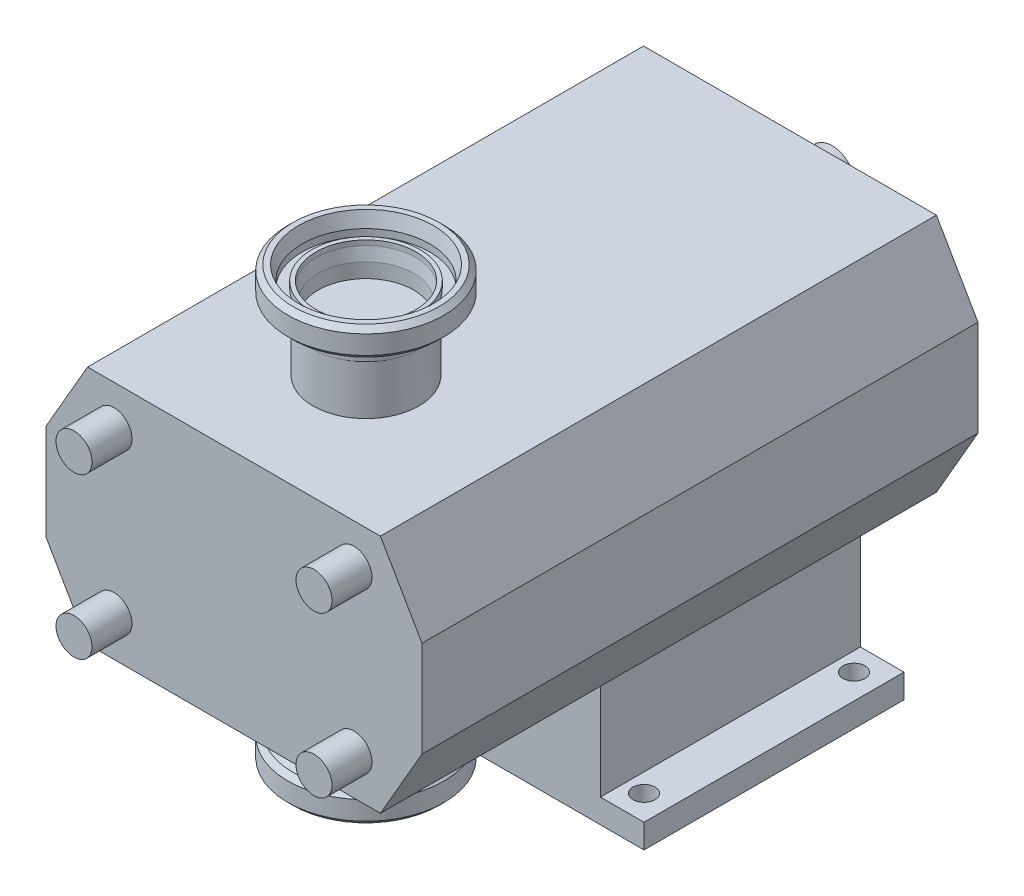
ISO-10303-21;
HEADER;
FILE_DESCRIPTION(('STEP AP214'),'2;1');
FILE_NAME('part.step','',(''),(''),'','','');
FILE_SCHEMA(('AUTOMOTIVE_DESIGN { 1 0 10303 214 1 1 1 1 }'));
ENDSEC;
DATA;
#1=APPLICATION_CONTEXT('core data for automotive mechanical design processes');
#2=APPLICATION_PROTOCOL_DEFINITION('international standard','automotive_design',2000,#1);
#3=PRODUCT_CONTEXT('',#1,'mechanical');
#4=PRODUCT('Part','Part','',(#3));
#5=PRODUCT_RELATED_PRODUCT_CATEGORY('part','',(#4));
#6=PRODUCT_DEFINITION_FORMATION('','',#4);
#7=PRODUCT_DEFINITION_CONTEXT('part definition',#1,'design');
#8=PRODUCT_DEFINITION('design','',#6,#7);
#9=PRODUCT_DEFINITION_SHAPE('','',#8);
#10=(LENGTH_UNIT() NAMED_UNIT(*) SI_UNIT(.MILLI.,.METRE.));
#11=(NAMED_UNIT(*) PLANE_ANGLE_UNIT() SI_UNIT($,.RADIAN.));
#12=(NAMED_UNIT(*) SI_UNIT($,.STERADIAN.) SOLID_ANGLE_UNIT());
#13=UNCERTAINTY_MEASURE_WITH_UNIT(LENGTH_MEASURE(1.E-05),#10,'distance_accuracy_value','');
#14=(GEOMETRIC_REPRESENTATION_CONTEXT(3) GLOBAL_UNCERTAINTY_ASSIGNED_CONTEXT((#13)) GLOBAL_UNIT_ASSIGNED_CONTEXT((#10,
#11,#12)) REPRESENTATION_CONTEXT('',''));
#15=CARTESIAN_POINT('',(0.,0.,0.));
#16=DIRECTION('',(0.,0.,1.));
#17=DIRECTION('',(1.,0.,0.));
#18=AXIS2_PLACEMENT_3D('',#15,#16,#17);
#19=CARTESIAN_POINT('',(-24.3219270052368,-97.5,200.276354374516));
#20=DIRECTION('',(0.,-1.,0.));
#21=DIRECTION('',(-0.434209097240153,0.,0.900812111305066));
#22=AXIS2_PLACEMENT_3D('',#19,#20,#21);
#23=PLANE('',#22);
#24=CARTESIAN_POINT('',(0.,-97.5,212.));
#25=DIRECTION('',(0.,1.,0.));
#26=DIRECTION('',(0.434209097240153,0.,-0.900812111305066));
#27=AXIS2_PLACEMENT_3D('',#24,#25,#26);
#28=CIRCLE('',#27,27.);
#29=CARTESIAN_POINT('',(11.7236456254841,-97.5,187.678072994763));
#30=VERTEX_POINT('',#29);
#31=EDGE_CURVE('P0_E66',#30,#30,#28,.T.);
#32=ORIENTED_EDGE('',*,*,#31,.T.);
#33=EDGE_LOOP('',(#32));
#34=FACE_BOUND('',#33,.T.);
#35=CARTESIAN_POINT('',(0.,-97.5,212.));
#36=DIRECTION('',(0.,1.,0.));
#37=DIRECTION('',(0.434209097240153,0.,-0.900812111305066));
#38=AXIS2_PLACEMENT_3D('',#35,#36,#37);
#39=CIRCLE('',#38,31.9);
#40=CARTESIAN_POINT('',(13.8512702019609,-97.5,183.264093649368));
#41=VERTEX_POINT('',#40);
#42=EDGE_CURVE('P0_E9',#41,#41,#39,.T.);
#43=ORIENTED_EDGE('',*,*,#42,.F.);
#44=EDGE_LOOP('',(#43));
#45=FACE_BOUND('',#44,.T.);
#46=ADVANCED_FACE('P0_F14',(#34,#45),#23,.T.);
#47=CARTESIAN_POINT('',(0.,-85.,212.));
#48=DIRECTION('',(0.,1.,0.));
#49=DIRECTION('',(0.434209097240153,0.,-0.900812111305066));
#50=AXIS2_PLACEMENT_3D('',#47,#48,#49);
#51=CYLINDRICAL_SURFACE('',#50,31.9);
#52=ORIENTED_EDGE('',*,*,#42,.T.);
#53=EDGE_LOOP('',(#52));
#54=FACE_BOUND('',#53,.T.);
#55=CARTESIAN_POINT('',(0.,-101.,212.));
#56=DIRECTION('',(0.,1.,0.));
#57=DIRECTION('',(0.434209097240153,0.,-0.900812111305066));
#58=AXIS2_PLACEMENT_3D('',#55,#56,#57);
#59=CIRCLE('',#58,31.9);
#60=CARTESIAN_POINT('',(13.8512702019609,-101.,183.264093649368));
#61=VERTEX_POINT('',#60);
#62=EDGE_CURVE('P0_E20',#61,#61,#59,.T.);
#63=ORIENTED_EDGE('',*,*,#62,.F.);
#64=EDGE_LOOP('',(#63));
#65=FACE_BOUND('',#64,.T.);
#66=ADVANCED_FACE('P0_F85',(#54,#65),#51,.F.);
#67=CARTESIAN_POINT('',(0.,-108.,212.));
#68=DIRECTION('',(0.,-1.,0.));
#69=DIRECTION('',(-0.434209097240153,0.,0.900812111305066));
#70=AXIS2_PLACEMENT_3D('',#67,#68,#69);
#71=CONICAL_SURFACE('',#70,33.7756443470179,0.261799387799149);
#72=ORIENTED_EDGE('',*,*,#62,.T.);
#73=EDGE_LOOP('',(#72));
#74=FACE_BOUND('',#73,.T.);
#75=CARTESIAN_POINT('',(0.,-108.,212.));
#76=DIRECTION('',(0.,1.,0.));
#77=DIRECTION('',(0.434209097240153,0.,-0.900812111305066));
#78=AXIS2_PLACEMENT_3D('',#75,#76,#77);
#79=CIRCLE('',#78,33.7756443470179);
#80=CARTESIAN_POINT('',(14.6656920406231,-108.,181.574490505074));
#81=VERTEX_POINT('',#80);
#82=EDGE_CURVE('P0_E24',#81,#81,#79,.T.);
#83=ORIENTED_EDGE('',*,*,#82,.F.);
#84=EDGE_LOOP('',(#83));
#85=FACE_BOUND('',#84,.T.);
#86=ADVANCED_FACE('P0_F89',(#74,#85),#71,.F.);
#87=CARTESIAN_POINT('',(-30.4255094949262,-108.,197.334307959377));
#88=DIRECTION('',(0.,-1.,0.));
#89=DIRECTION('',(-0.434209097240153,0.,0.900812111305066));
#90=AXIS2_PLACEMENT_3D('',#87,#88,#89);
#91=PLANE('',#90);
#92=ORIENTED_EDGE('',*,*,#82,.T.);
#93=EDGE_LOOP('',(#92));
#94=FACE_BOUND('',#93,.T.);
#95=CARTESIAN_POINT('',(0.,-108.,212.));
#96=DIRECTION('',(0.,1.,0.));
#97=DIRECTION('',(0.434209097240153,0.,-0.900812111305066));
#98=AXIS2_PLACEMENT_3D('',#95,#96,#97);
#99=CIRCLE('',#98,36.5);
#100=CARTESIAN_POINT('',(15.8486320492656,-108.,179.120357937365));
#101=VERTEX_POINT('',#100);
#102=EDGE_CURVE('P0_E28',#101,#101,#99,.T.);
#103=ORIENTED_EDGE('',*,*,#102,.F.);
#104=EDGE_LOOP('',(#103));
#105=FACE_BOUND('',#104,.T.);
#106=ADVANCED_FACE('P0_F93',(#94,#105),#91,.T.);
#107=CARTESIAN_POINT('',(0.,-105.5,212.));
#108=DIRECTION('',(0.,1.,0.));
#109=DIRECTION('',(0.434209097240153,0.,-0.900812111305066));
#110=AXIS2_PLACEMENT_3D('',#107,#108,#109);
#111=CONICAL_SURFACE('',#110,39.,0.785398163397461);
#112=ORIENTED_EDGE('',*,*,#102,.T.);
#113=EDGE_LOOP('',(#112));
#114=FACE_BOUND('',#113,.T.);
#115=CARTESIAN_POINT('',(0.,-105.5,212.));
#116=DIRECTION('',(0.,1.,0.));
#117=DIRECTION('',(0.434209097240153,0.,-0.900812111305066));
#118=AXIS2_PLACEMENT_3D('',#115,#116,#117);
#119=CIRCLE('',#118,39.);
#120=CARTESIAN_POINT('',(16.934154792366,-105.5,176.868327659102));
#121=VERTEX_POINT('',#120);
#122=EDGE_CURVE('P0_E33',#121,#121,#119,.T.);
#123=ORIENTED_EDGE('',*,*,#122,.F.);
#124=EDGE_LOOP('',(#123));
#125=FACE_BOUND('',#124,.T.);
#126=ADVANCED_FACE('P0_F99',(#114,#125),#111,.T.);
#127=CARTESIAN_POINT('',(0.,-85.,212.));
#128=DIRECTION('',(0.,1.,0.));
#129=DIRECTION('',(0.434209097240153,0.,-0.900812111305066));
#130=AXIS2_PLACEMENT_3D('',#127,#128,#129);
#131=CYLINDRICAL_SURFACE('',#130,39.);
#132=ORIENTED_EDGE('',*,*,#122,.T.);
#133=EDGE_LOOP('',(#132));
#134=FACE_BOUND('',#133,.T.);
#135=CARTESIAN_POINT('',(0.,-96.1751063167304,212.));
#136=DIRECTION('',(0.,1.,0.));
#137=DIRECTION('',(0.434209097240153,0.,-0.900812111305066));
#138=AXIS2_PLACEMENT_3D('',#135,#136,#137);
#139=CIRCLE('',#138,39.);
#140=CARTESIAN_POINT('',(16.934154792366,-96.1751063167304,176.868327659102));
#141=VERTEX_POINT('',#140);
#142=EDGE_CURVE('P0_E36',#141,#141,#139,.T.);
#143=ORIENTED_EDGE('',*,*,#142,.F.);
#144=EDGE_LOOP('',(#143));
#145=FACE_BOUND('',#144,.T.);
#146=ADVANCED_FACE('P0_F103',(#134,#145),#131,.T.);
#147=CARTESIAN_POINT('',(0.,-93.6751063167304,212.));
#148=DIRECTION('',(0.,-1.,0.));
#149=DIRECTION('',(-0.434209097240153,0.,0.900812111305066));
#150=AXIS2_PLACEMENT_3D('',#147,#148,#149);
#151=CONICAL_SURFACE('',#150,36.5,0.785398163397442);
#152=ORIENTED_EDGE('',*,*,#142,.T.);
#153=EDGE_LOOP('',(#152));
#154=FACE_BOUND('',#153,.T.);
#155=CARTESIAN_POINT('',(0.,-93.6751063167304,212.));
#156=DIRECTION('',(0.,1.,0.));
#157=DIRECTION('',(0.434209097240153,0.,-0.900812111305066));
#158=AXIS2_PLACEMENT_3D('',#155,#156,#157);
#159=CIRCLE('',#158,36.5);
#160=CARTESIAN_POINT('',(15.8486320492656,-93.6751063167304,179.120357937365));
#161=VERTEX_POINT('',#160);
#162=EDGE_CURVE('P0_E39',#161,#161,#159,.T.);
#163=ORIENTED_EDGE('',*,*,#162,.F.);
#164=EDGE_LOOP('',(#163));
#165=FACE_BOUND('',#164,.T.);
#166=ADVANCED_FACE('P0_F107',(#154,#165),#151,.T.);
#167=CARTESIAN_POINT('',(0.,-92.3642703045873,212.));
#168=DIRECTION('',(0.,-1.,0.));
#169=DIRECTION('',(-0.434209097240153,0.,0.900812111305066));
#170=AXIS2_PLACEMENT_3D('',#167,#168,#169);
#171=CONICAL_SURFACE('',#170,29.0658795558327,1.39626340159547);
#172=ORIENTED_EDGE('',*,*,#162,.T.);
#173=EDGE_LOOP('',(#172));
#174=FACE_BOUND('',#173,.T.);
#175=CARTESIAN_POINT('',(0.,-92.3642703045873,212.));
#176=DIRECTION('',(0.,1.,0.));
#177=DIRECTION('',(0.434209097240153,0.,-0.900812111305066));
#178=AXIS2_PLACEMENT_3D('',#175,#176,#177);
#179=CIRCLE('',#178,29.0658795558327);
#180=CARTESIAN_POINT('',(12.6206693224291,-92.3642703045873,185.817103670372));
#181=VERTEX_POINT('',#180);
#182=EDGE_CURVE('P0_E42',#181,#181,#179,.T.);
#183=ORIENTED_EDGE('',*,*,#182,.F.);
#184=EDGE_LOOP('',(#183));
#185=FACE_BOUND('',#184,.T.);
#186=ADVANCED_FACE('P0_F111',(#174,#185),#171,.T.);
#187=CARTESIAN_POINT('',(0.,-89.9022509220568,212.));
#188=DIRECTION('',(0.,1.,0.));
#189=DIRECTION('',(0.434209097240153,0.,-0.900812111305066));
#190=AXIS2_PLACEMENT_3D('',#187,#188,#189);
#191=TOROIDAL_SURFACE('',#190,29.5,2.5);
#192=ORIENTED_EDGE('',*,*,#182,.T.);
#193=EDGE_LOOP('',(#192));
#194=FACE_BOUND('',#193,.T.);
#195=CARTESIAN_POINT('',(0.,-89.9022509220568,212.));
#196=DIRECTION('',(0.,1.,0.));
#197=DIRECTION('',(0.434209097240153,0.,-0.900812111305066));
#198=AXIS2_PLACEMENT_3D('',#195,#196,#197);
#199=CIRCLE('',#198,27.);
#200=CARTESIAN_POINT('',(11.7236456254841,-89.9022509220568,187.678072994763));
#201=VERTEX_POINT('',#200);
#202=EDGE_CURVE('P0_E45',#201,#201,#199,.T.);
#203=ORIENTED_EDGE('',*,*,#202,.F.);
#204=EDGE_LOOP('',(#203));
#205=FACE_BOUND('',#204,.T.);
#206=ADVANCED_FACE('P0_F115',(#194,#205),#191,.F.);
#207=CARTESIAN_POINT('',(0.,-85.,212.));
#208=DIRECTION('',(0.,1.,0.));
#209=DIRECTION('',(0.434209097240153,0.,-0.900812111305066));
#210=AXIS2_PLACEMENT_3D('',#207,#208,#209);
#211=CYLINDRICAL_SURFACE('',#210,27.);
#212=ORIENTED_EDGE('',*,*,#202,.T.);
#213=EDGE_LOOP('',(#212));
#214=FACE_BOUND('',#213,.T.);
#215=CARTESIAN_POINT('',(0.,-85.,212.));
#216=DIRECTION('',(0.,1.,0.));
#217=DIRECTION('',(0.434209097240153,0.,-0.900812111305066));
#218=AXIS2_PLACEMENT_3D('',#215,#216,#217);
#219=CIRCLE('',#218,27.);
#220=CARTESIAN_POINT('',(11.7236456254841,-85.,187.678072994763));
#221=VERTEX_POINT('',#220);
#222=EDGE_CURVE('P0_E48',#221,#221,#219,.T.);
#223=ORIENTED_EDGE('',*,*,#222,.F.);
#224=EDGE_LOOP('',(#223));
#225=FACE_BOUND('',#224,.T.);
#226=ADVANCED_FACE('P0_F119',(#214,#225),#211,.T.);
#227=CARTESIAN_POINT('',(-21.5294094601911,-85.,201.62240257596));
#228=DIRECTION('',(0.,1.,0.));
#229=DIRECTION('',(0.434209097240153,0.,-0.900812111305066));
#230=AXIS2_PLACEMENT_3D('',#227,#228,#229);
#231=PLANE('',#230);
#232=ORIENTED_EDGE('',*,*,#222,.T.);
#233=EDGE_LOOP('',(#232));
#234=FACE_BOUND('',#233,.T.);
#235=CARTESIAN_POINT('',(0.,-85.,212.));
#236=DIRECTION('',(0.,1.,0.));
#237=DIRECTION('',(0.434209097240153,0.,-0.900812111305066));
#238=AXIS2_PLACEMENT_3D('',#235,#236,#237);
#239=CIRCLE('',#238,23.9);
#240=CARTESIAN_POINT('',(10.3775974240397,-85.,190.470590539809));
#241=VERTEX_POINT('',#240);
#242=EDGE_CURVE('P0_E51',#241,#241,#239,.T.);
#243=ORIENTED_EDGE('',*,*,#242,.F.);
#244=EDGE_LOOP('',(#243));
#245=FACE_BOUND('',#244,.T.);
#246=ADVANCED_FACE('P0_F123',(#234,#245),#231,.T.);
#247=CARTESIAN_POINT('',(0.,-85.,212.));
#248=DIRECTION('',(0.,1.,0.));
#249=DIRECTION('',(0.434209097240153,0.,-0.900812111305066));
#250=AXIS2_PLACEMENT_3D('',#247,#248,#249);
#251=CYLINDRICAL_SURFACE('',#250,23.9);
#252=ORIENTED_EDGE('',*,*,#242,.T.);
#253=EDGE_LOOP('',(#252));
#254=FACE_BOUND('',#253,.T.);
#255=CARTESIAN_POINT('',(0.,-92.2615899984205,212.));
#256=DIRECTION('',(0.,1.,0.));
#257=DIRECTION('',(0.434209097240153,0.,-0.900812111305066));
#258=AXIS2_PLACEMENT_3D('',#255,#256,#257);
#259=CIRCLE('',#258,23.9);
#260=CARTESIAN_POINT('',(10.3775974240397,-92.2615899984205,190.470590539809));
#261=VERTEX_POINT('',#260);
#262=EDGE_CURVE('P0_E54',#261,#261,#259,.T.);
#263=ORIENTED_EDGE('',*,*,#262,.F.);
#264=EDGE_LOOP('',(#263));
#265=FACE_BOUND('',#264,.T.);
#266=ADVANCED_FACE('P0_F127',(#254,#265),#251,.F.);
#267=CARTESIAN_POINT('',(0.,-98.5,212.));
#268=DIRECTION('',(0.,-1.,0.));
#269=DIRECTION('',(-0.434209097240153,0.,0.900812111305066));
#270=AXIS2_PLACEMENT_3D('',#267,#268,#269);
#271=CONICAL_SURFACE('',#270,25.,0.174532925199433);
#272=ORIENTED_EDGE('',*,*,#262,.T.);
#273=EDGE_LOOP('',(#272));
#274=FACE_BOUND('',#273,.T.);
#275=CARTESIAN_POINT('',(0.,-98.5,212.));
#276=DIRECTION('',(0.,1.,0.));
#277=DIRECTION('',(0.434209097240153,0.,-0.900812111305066));
#278=AXIS2_PLACEMENT_3D('',#275,#276,#277);
#279=CIRCLE('',#278,25.);
#280=CARTESIAN_POINT('',(10.8552274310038,-98.5,189.479697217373));
#281=VERTEX_POINT('',#280);
#282=EDGE_CURVE('P0_E57',#281,#281,#279,.T.);
#283=ORIENTED_EDGE('',*,*,#282,.F.);
#284=EDGE_LOOP('',(#283));
#285=FACE_BOUND('',#284,.T.);
#286=ADVANCED_FACE('P0_F131',(#274,#285),#271,.F.);
#287=CARTESIAN_POINT('',(0.,-85.,212.));
#288=DIRECTION('',(0.,1.,0.));
#289=DIRECTION('',(0.434209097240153,0.,-0.900812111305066));
#290=AXIS2_PLACEMENT_3D('',#287,#288,#289);
#291=CYLINDRICAL_SURFACE('',#290,25.);
#292=ORIENTED_EDGE('',*,*,#282,.T.);
#293=EDGE_LOOP('',(#292));
#294=FACE_BOUND('',#293,.T.);
#295=CARTESIAN_POINT('',(0.,-101.,212.));
#296=DIRECTION('',(0.,1.,0.));
#297=DIRECTION('',(0.434209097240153,0.,-0.900812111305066));
#298=AXIS2_PLACEMENT_3D('',#295,#296,#297);
#299=CIRCLE('',#298,25.);
#300=CARTESIAN_POINT('',(10.8552274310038,-101.,189.479697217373));
#301=VERTEX_POINT('',#300);
#302=EDGE_CURVE('P0_E60',#301,#301,#299,.T.);
#303=ORIENTED_EDGE('',*,*,#302,.F.);
#304=EDGE_LOOP('',(#303));
#305=FACE_BOUND('',#304,.T.);
#306=ADVANCED_FACE('P0_F81',(#294,#305),#291,.F.);
#307=CARTESIAN_POINT('',(-22.5203027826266,-101.,201.144772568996));
#308=DIRECTION('',(0.,-1.,0.));
#309=DIRECTION('',(-0.434209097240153,0.,0.900812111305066));
#310=AXIS2_PLACEMENT_3D('',#307,#308,#309);
#311=PLANE('',#310);
#312=ORIENTED_EDGE('',*,*,#302,.T.);
#313=EDGE_LOOP('',(#312));
#314=FACE_BOUND('',#313,.T.);
#315=CARTESIAN_POINT('',(0.,-101.,212.));
#316=DIRECTION('',(0.,1.,0.));
#317=DIRECTION('',(0.434209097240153,0.,-0.900812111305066));
#318=AXIS2_PLACEMENT_3D('',#315,#316,#317);
#319=CIRCLE('',#318,27.);
#320=CARTESIAN_POINT('',(11.7236456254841,-101.,187.678072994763));
#321=VERTEX_POINT('',#320);
#322=EDGE_CURVE('P0_E63',#321,#321,#319,.T.);
#323=ORIENTED_EDGE('',*,*,#322,.F.);
#324=EDGE_LOOP('',(#323));
#325=FACE_BOUND('',#324,.T.);
#326=ADVANCED_FACE('P0_F74',(#314,#325),#311,.T.);
#327=CARTESIAN_POINT('',(0.,-85.,212.));
#328=DIRECTION('',(0.,1.,0.));
#329=DIRECTION('',(0.434209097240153,0.,-0.900812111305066));
#330=AXIS2_PLACEMENT_3D('',#327,#328,#329);
#331=CYLINDRICAL_SURFACE('',#330,27.);
#332=ORIENTED_EDGE('',*,*,#322,.T.);
#333=EDGE_LOOP('',(#332));
#334=FACE_BOUND('',#333,.T.);
#335=ORIENTED_EDGE('',*,*,#31,.F.);
#336=EDGE_LOOP('',(#335));
#337=FACE_BOUND('',#336,.T.);
#338=ADVANCED_FACE('P0_F72',(#334,#337),#331,.T.);
#339=CLOSED_SHELL('',(#46,#66,#86,#106,#126,#146,#166,#186,#206,#226,#246,#266,#286,#306,#326,#338));
#340=MANIFOLD_SOLID_BREP('P0_B1',#339);
#341=CARTESIAN_POINT('',(-31.,0.,241.732657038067));
#342=DIRECTION('',(0.,0.,1.));
#343=DIRECTION('',(1.,0.,0.));
#344=AXIS2_PLACEMENT_3D('',#341,#342,#343);
#345=CYLINDRICAL_SURFACE('',#344,12.);
#346=CARTESIAN_POINT('',(-31.,0.,-2.));
#347=DIRECTION('',(0.,0.,1.));
#348=DIRECTION('',(1.,0.,0.));
#349=AXIS2_PLACEMENT_3D('',#346,#347,#348);
#350=CIRCLE('',#349,12.);
#351=CARTESIAN_POINT('',(-19.,0.,-2.));
#352=VERTEX_POINT('',#351);
#353=EDGE_CURVE('P1_E277',#352,#352,#350,.T.);
#354=ORIENTED_EDGE('',*,*,#353,.F.);
#355=EDGE_LOOP('',(#354));
#356=FACE_BOUND('',#355,.T.);
#357=DIRECTION('',(0.,0.,1.));
#358=VECTOR('',#357,1.);
#359=CARTESIAN_POINT('',(-19.6862915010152,3.99999999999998,241.732657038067));
#360=LINE('',#359,#358);
#361=CARTESIAN_POINT('',(-19.6862915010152,4.,-52.));
#362=VERTEX_POINT('',#361);
#363=CARTESIAN_POINT('',(-19.6862915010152,4.,-22.));
#364=VERTEX_POINT('',#363);
#365=EDGE_CURVE('P1_E178',#362,#364,#360,.T.);
#366=ORIENTED_EDGE('',*,*,#365,.F.);
#367=CARTESIAN_POINT('',(-31.,0.,-52.));
#368=DIRECTION('',(0.,0.,1.));
#369=DIRECTION('',(1.,0.,0.));
#370=AXIS2_PLACEMENT_3D('',#367,#368,#369);
#371=CIRCLE('',#370,12.);
#372=CARTESIAN_POINT('',(-19.6862915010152,-4.,-52.));
#373=VERTEX_POINT('',#372);
#374=EDGE_CURVE('P1_E176',#362,#373,#371,.T.);
#375=ORIENTED_EDGE('',*,*,#374,.T.);
#376=DIRECTION('',(0.,0.,1.));
#377=VECTOR('',#376,1.);
#378=CARTESIAN_POINT('',(-19.6862915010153,-4.00000000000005,241.732657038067));
#379=LINE('',#378,#377);
#380=CARTESIAN_POINT('',(-19.6862915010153,-4.00000000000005,-22.));
#381=VERTEX_POINT('',#380);
#382=EDGE_CURVE('P1_E39',#381,#373,#379,.F.);
#383=ORIENTED_EDGE('',*,*,#382,.F.);
#384=CARTESIAN_POINT('',(-19.,0.,-26.));
#385=CARTESIAN_POINT('',(-18.9999993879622,0.218253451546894,-26.0000010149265));
#386=CARTESIAN_POINT('',(-19.0060092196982,0.436500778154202,-25.9820789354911));
#387=CARTESIAN_POINT('',(-19.0293915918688,0.866567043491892,-25.9110835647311));
#388=CARTESIAN_POINT('',(-19.0467653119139,1.07838531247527,-25.8580066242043));
#389=CARTESIAN_POINT('',(-19.0909876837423,1.4893311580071,-25.7187230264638));
#390=CARTESIAN_POINT('',(-19.1178204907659,1.68847930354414,-25.6325717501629));
#391=CARTESIAN_POINT('',(-19.1782221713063,2.0694997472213,-25.4298353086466));
#392=CARTESIAN_POINT('',(-19.2117923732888,2.25136862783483,-25.3132441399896));
#393=CARTESIAN_POINT('',(-19.2834362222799,2.59896670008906,-25.048696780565));
#394=CARTESIAN_POINT('',(-19.3216177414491,2.76401480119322,-24.899875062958));
#395=CARTESIAN_POINT('',(-19.3975874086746,3.06733077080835,-24.5769313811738));
#396=CARTESIAN_POINT('',(-19.4353754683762,3.20559274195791,-24.4028038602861));
#397=CARTESIAN_POINT('',(-19.5074667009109,3.45529976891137,-24.028059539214));
#398=CARTESIAN_POINT('',(-19.5416384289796,3.5658594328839,-23.826825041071));
#399=CARTESIAN_POINT('',(-19.6009877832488,3.75127549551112,-23.4072956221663));
#400=CARTESIAN_POINT('',(-19.6261681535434,3.82614278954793,-23.1890059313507));
#401=CARTESIAN_POINT('',(-19.6635478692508,3.93549384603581,-22.7493071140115));
#402=CARTESIAN_POINT('',(-19.6761561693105,3.97125379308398,-22.5282511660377));
#403=CARTESIAN_POINT('',(-19.6881737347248,4.005364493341,-22.0829449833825));
#404=CARTESIAN_POINT('',(-19.687587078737,4.00372680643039,-21.8586957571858));
#405=CARTESIAN_POINT('',(-19.6736394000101,3.96407961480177,-21.4242534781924));
#406=CARTESIAN_POINT('',(-19.6608633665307,3.92773565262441,-21.2138863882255));
#407=CARTESIAN_POINT('',(-19.6249336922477,3.82242465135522,-20.8024263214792));
#408=CARTESIAN_POINT('',(-19.6017788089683,3.75345370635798,-20.601334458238));
#409=CARTESIAN_POINT('',(-19.5472835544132,3.58375623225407,-20.2103490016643));
#410=CARTESIAN_POINT('',(-19.5158173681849,3.4825361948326,-20.02068789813));
#411=CARTESIAN_POINT('',(-19.4482976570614,3.251556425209,-19.660516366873));
#412=CARTESIAN_POINT('',(-19.4122428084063,3.12178844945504,-19.4900114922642));
#413=CARTESIAN_POINT('',(-19.3373068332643,2.82939733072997,-19.1636336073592));
#414=CARTESIAN_POINT('',(-19.2983764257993,2.66541260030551,-19.0089892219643));
#415=CARTESIAN_POINT('',(-19.2237224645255,2.31335827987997,-18.7290749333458));
#416=CARTESIAN_POINT('',(-19.1879992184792,2.12528638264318,-18.6038078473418));
#417=CARTESIAN_POINT('',(-19.1233156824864,1.72779045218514,-18.3852147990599));
#418=CARTESIAN_POINT('',(-19.0944259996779,1.51817310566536,-18.2922180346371));
#419=CARTESIAN_POINT('',(-19.0471773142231,1.085076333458,-18.1431873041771));
#420=CARTESIAN_POINT('',(-19.028814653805,0.861601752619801,-18.0871404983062));
#421=CARTESIAN_POINT('',(-19.0052949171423,0.417535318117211,-18.0157773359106));
#422=CARTESIAN_POINT('',(-18.9995999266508,0.197238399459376,-17.998800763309));
#423=CARTESIAN_POINT('',(-19.0004438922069,-0.24310027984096,-18.0013306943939));
#424=CARTESIAN_POINT('',(-19.0069807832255,-0.463142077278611,-18.0208310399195));
#425=CARTESIAN_POINT('',(-19.0311990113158,-0.89007946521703,-18.0944476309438));
#426=CARTESIAN_POINT('',(-19.0485520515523,-1.09717122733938,-18.147544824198));
#427=CARTESIAN_POINT('',(-19.0923261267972,-1.4994238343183,-18.2855737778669));
#428=CARTESIAN_POINT('',(-19.118748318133,-1.69458315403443,-18.3705095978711));
#429=CARTESIAN_POINT('',(-19.1788427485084,-2.0731531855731,-18.5722817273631));
#430=CARTESIAN_POINT('',(-19.2126874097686,-2.25611983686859,-18.6898983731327));
#431=CARTESIAN_POINT('',(-19.2837898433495,-2.60025932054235,-18.9527766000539));
#432=CARTESIAN_POINT('',(-19.3210486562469,-2.76142547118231,-19.0980466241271));
#433=CARTESIAN_POINT('',(-19.3969260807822,-3.06501003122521,-19.4199150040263));
#434=CARTESIAN_POINT('',(-19.4355295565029,-3.20624387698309,-19.5976369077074));
#435=CARTESIAN_POINT('',(-19.5080010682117,-3.45703008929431,-19.9750862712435));
#436=CARTESIAN_POINT('',(-19.5418690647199,-3.56658219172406,-20.1748139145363));
#437=CARTESIAN_POINT('',(-19.6007043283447,-3.75038772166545,-20.5906920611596));
#438=CARTESIAN_POINT('',(-19.6256895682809,-3.82471252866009,-20.8068083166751));
#439=CARTESIAN_POINT('',(-19.663566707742,-3.93557866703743,-21.2495146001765));
#440=CARTESIAN_POINT('',(-19.6764640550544,-3.97213701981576,-21.4760998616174));
#441=CARTESIAN_POINT('',(-19.6880856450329,-4.00510512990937,-21.9207883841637));
#442=CARTESIAN_POINT('',(-19.6875039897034,-4.0034810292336,-22.1387293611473));
#443=CARTESIAN_POINT('',(-19.6739492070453,-3.96496917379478,-22.5710602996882));
#444=CARTESIAN_POINT('',(-19.6609768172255,-3.92808351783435,-22.7854504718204));
#445=CARTESIAN_POINT('',(-19.6246190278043,-3.82148725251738,-23.2005426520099));
#446=CARTESIAN_POINT('',(-19.6014360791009,-3.75241338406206,-23.401427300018));
#447=CARTESIAN_POINT('',(-19.5473440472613,-3.58391746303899,-23.7889096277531));
#448=CARTESIAN_POINT('',(-19.5164332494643,-3.48448867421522,-23.975504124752));
#449=CARTESIAN_POINT('',(-19.4486868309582,-3.25304277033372,-24.3379346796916));
#450=CARTESIAN_POINT('',(-19.4116515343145,-3.11979297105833,-24.5129460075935));
#451=CARTESIAN_POINT('',(-19.3366657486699,-2.8265715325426,-24.8387592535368));
#452=CARTESIAN_POINT('',(-19.2987150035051,-2.66659233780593,-24.9895543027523));
#453=CARTESIAN_POINT('',(-19.2243987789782,-2.31696622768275,-25.2685776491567));
#454=CARTESIAN_POINT('',(-19.1881527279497,-2.12640605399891,-25.395697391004));
#455=CARTESIAN_POINT('',(-19.1229603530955,-1.7254294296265,-25.6159617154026));
#456=CARTESIAN_POINT('',(-19.0940121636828,-1.51501807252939,-25.7091149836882));
#457=CARTESIAN_POINT('',(-19.0477793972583,-1.0899745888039,-25.8548865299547));
#458=CARTESIAN_POINT('',(-19.0300315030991,-0.875951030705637,-25.9091298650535));
#459=CARTESIAN_POINT('',(-19.0061437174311,-0.441281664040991,-25.9816811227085));
#460=CARTESIAN_POINT('',(-19.0000006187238,-0.220637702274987,-25.9999989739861));
#461=CARTESIAN_POINT('',(-19.,0.,-26.));
#462=B_SPLINE_CURVE_WITH_KNOTS('',3,(#384,#385,#386,#387,#388,#389,#390,#391,#392,#393,#394,
#395,#396,#397,#398,#399,#400,#401,#402,#403,#404,#405,#406,#407,#408,#409,#410,#411,#412,#413,
#414,#415,#416,#417,#418,#419,#420,#421,#422,#423,#424,#425,#426,#427,#428,#429,#430,#431,#432,
#433,#434,#435,#436,#437,#438,#439,#440,#441,#442,#443,#444,#445,#446,#447,#448,#449,#450,#451,
#452,#453,#454,#455,#456,#457,#458,#459,#460,#461),.UNSPECIFIED.,.T.,.F.,(4,2,2,2,2,2,2,2,2,2,2,
2,2,2,2,2,2,2,2,2,2,2,2,2,2,2,2,2,2,2,2,2,2,2,2,2,2,2,4),(0.,0.653948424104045,1.30796474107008,
1.96089069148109,2.6139455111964,3.28738737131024,3.96097733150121,4.65393539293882,
5.34668178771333,6.01607702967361,6.68526535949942,7.32387306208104,7.96255723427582,
8.61152684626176,9.26068410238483,9.94373223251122,10.6268458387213,11.3167362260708,
12.0063867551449,12.6661433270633,13.3257885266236,13.9663263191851,14.6069458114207,
15.264415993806,15.9220872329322,16.6096409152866,17.2972003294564,17.9833605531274,
18.6692113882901,19.3198266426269,19.9704031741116,20.6086234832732,21.2469855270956,
21.9132026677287,22.5796084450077,23.2719864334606,23.9641872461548,24.6254623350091,
25.2865546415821),.UNSPECIFIED.);
#463=EDGE_CURVE('P1_E11',#364,#381,#462,.T.);
#464=ORIENTED_EDGE('',*,*,#463,.F.);
#465=EDGE_LOOP('',(#366,#375,#383,#464));
#466=FACE_BOUND('',#465,.T.);
#467=ADVANCED_FACE('P1_F17',(#356,#466),#345,.T.);
#468=CARTESIAN_POINT('',(-73.2153903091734,-60.,278.));
#469=DIRECTION('',(0.,1.,0.));
#470=DIRECTION('',(-1.,0.,0.));
#471=AXIS2_PLACEMENT_3D('',#468,#469,#470);
#472=PLANE('',#471);
#473=CARTESIAN_POINT('',(0.,-60.,212.));
#474=DIRECTION('',(0.,1.,0.));
#475=DIRECTION('',(-1.,0.,0.));
#476=AXIS2_PLACEMENT_3D('',#473,#474,#475);
#477=CIRCLE('',#476,26.5);
#478=CARTESIAN_POINT('',(-26.5,-60.,212.));
#479=VERTEX_POINT('',#478);
#480=EDGE_CURVE('P1_E192',#479,#479,#477,.T.);
#481=ORIENTED_EDGE('',*,*,#480,.T.);
#482=EDGE_LOOP('',(#481));
#483=FACE_BOUND('',#482,.T.);
#484=DIRECTION('',(1.,0.,0.));
#485=VECTOR('',#484,1.);
#486=CARTESIAN_POINT('',(-73.2153903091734,-60.,0.));
#487=LINE('',#486,#485);
#488=CARTESIAN_POINT('',(-73.2153903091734,-60.,0.));
#489=VERTEX_POINT('',#488);
#490=CARTESIAN_POINT('',(73.2153903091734,-60.,0.));
#491=VERTEX_POINT('',#490);
#492=EDGE_CURVE('P1_E337',#489,#491,#487,.T.);
#493=ORIENTED_EDGE('',*,*,#492,.T.);
#494=DIRECTION('',(0.,0.,-1.));
#495=VECTOR('',#494,1.);
#496=CARTESIAN_POINT('',(73.2153903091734,-60.,278.));
#497=LINE('',#496,#495);
#498=CARTESIAN_POINT('',(73.2153903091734,-60.,278.));
#499=VERTEX_POINT('',#498);
#500=EDGE_CURVE('P1_E347',#499,#491,#497,.T.);
#501=ORIENTED_EDGE('',*,*,#500,.F.);
#502=DIRECTION('',(1.,0.,0.));
#503=VECTOR('',#502,1.);
#504=CARTESIAN_POINT('',(-73.2153903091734,-60.,278.));
#505=LINE('',#504,#503);
#506=CARTESIAN_POINT('',(-73.2153903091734,-60.,278.));
#507=VERTEX_POINT('',#506);
#508=EDGE_CURVE('P1_E320',#507,#499,#505,.T.);
#509=ORIENTED_EDGE('',*,*,#508,.F.);
#510=DIRECTION('',(0.,0.,-1.));
#511=VECTOR('',#510,1.);
#512=CARTESIAN_POINT('',(-73.2153903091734,-60.,278.));
#513=LINE('',#512,#511);
#514=EDGE_CURVE('P1_E350',#507,#489,#513,.T.);
#515=ORIENTED_EDGE('',*,*,#514,.T.);
#516=EDGE_LOOP('',(#493,#501,#509,#515));
#517=FACE_BOUND('',#516,.T.);
#518=DIRECTION('',(1.,0.,0.));
#519=VECTOR('',#518,1.);
#520=CARTESIAN_POINT('',(53.2153903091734,-60.,18.));
#521=LINE('',#520,#519);
#522=CARTESIAN_POINT('',(-53.2153903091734,-60.,18.));
#523=VERTEX_POINT('',#522);
#524=CARTESIAN_POINT('',(53.2153903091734,-60.,18.));
#525=VERTEX_POINT('',#524);
#526=EDGE_CURVE('P1_E220',#523,#525,#521,.T.);
#527=ORIENTED_EDGE('',*,*,#526,.F.);
#528=DIRECTION('',(0.,0.,1.));
#529=VECTOR('',#528,1.);
#530=CARTESIAN_POINT('',(-53.2153903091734,-60.,18.));
#531=LINE('',#530,#529);
#532=CARTESIAN_POINT('',(-53.2153903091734,-60.,148.));
#533=VERTEX_POINT('',#532);
#534=EDGE_CURVE('P1_E238',#523,#533,#531,.T.);
#535=ORIENTED_EDGE('',*,*,#534,.T.);
#536=DIRECTION('',(1.,0.,0.));
#537=VECTOR('',#536,1.);
#538=CARTESIAN_POINT('',(53.2153903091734,-60.,148.));
#539=LINE('',#538,#537);
#540=CARTESIAN_POINT('',(53.2153903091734,-60.,148.));
#541=VERTEX_POINT('',#540);
#542=EDGE_CURVE('P1_E219',#533,#541,#539,.T.);
#543=ORIENTED_EDGE('',*,*,#542,.T.);
#544=DIRECTION('',(0.,0.,1.));
#545=VECTOR('',#544,1.);
#546=CARTESIAN_POINT('',(53.2153903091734,-60.,18.));
#547=LINE('',#546,#545);
#548=EDGE_CURVE('P1_E274',#525,#541,#547,.T.);
#549=ORIENTED_EDGE('',*,*,#548,.F.);
#550=EDGE_LOOP('',(#527,#535,#543,#549));
#551=FACE_BOUND('',#550,.T.);
#552=ADVANCED_FACE('P1_F393',(#483,#517,#551),#472,.F.);
#553=CARTESIAN_POINT('',(107.856406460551,0.,0.));
#554=DIRECTION('',(0.,0.,1.));
#555=DIRECTION('',(1.,0.,0.));
#556=AXIS2_PLACEMENT_3D('',#553,#554,#555);
#557=PLANE('',#556);
#558=DIRECTION('',(-0.500000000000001,0.866025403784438,0.));
#559=VECTOR('',#558,1.);
#560=CARTESIAN_POINT('',(73.2153903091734,60.,0.));
#561=LINE('',#560,#559);
#562=CARTESIAN_POINT('',(94.,24.,0.));
#563=VERTEX_POINT('',#562);
#564=CARTESIAN_POINT('',(73.2153903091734,60.,0.));
#565=VERTEX_POINT('',#564);
#566=EDGE_CURVE('P1_E305',#563,#565,#561,.T.);
#567=ORIENTED_EDGE('',*,*,#566,.F.);
#568=DIRECTION('',(0.,1.,0.));
#569=VECTOR('',#568,1.);
#570=CARTESIAN_POINT('',(94.,24.,0.));
#571=LINE('',#570,#569);
#572=CARTESIAN_POINT('',(94.,-24.,0.));
#573=VERTEX_POINT('',#572);
#574=EDGE_CURVE('P1_E312',#573,#563,#571,.T.);
#575=ORIENTED_EDGE('',*,*,#574,.F.);
#576=DIRECTION('',(0.500000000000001,0.866025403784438,0.));
#577=VECTOR('',#576,1.);
#578=CARTESIAN_POINT('',(73.2153903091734,-60.,0.));
#579=LINE('',#578,#577);
#580=EDGE_CURVE('P1_E339',#491,#573,#579,.T.);
#581=ORIENTED_EDGE('',*,*,#580,.F.);
#582=ORIENTED_EDGE('',*,*,#492,.F.);
#583=DIRECTION('',(0.500000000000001,-0.866025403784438,0.));
#584=VECTOR('',#583,1.);
#585=CARTESIAN_POINT('',(-73.2153903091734,-60.,0.));
#586=LINE('',#585,#584);
#587=CARTESIAN_POINT('',(-94.,-24.,0.));
#588=VERTEX_POINT('',#587);
#589=EDGE_CURVE('P1_E335',#588,#489,#586,.T.);
#590=ORIENTED_EDGE('',*,*,#589,.F.);
#591=DIRECTION('',(0.,-1.,0.));
#592=VECTOR('',#591,1.);
#593=CARTESIAN_POINT('',(-94.,24.,0.));
#594=LINE('',#593,#592);
#595=CARTESIAN_POINT('',(-94.,24.,0.));
#596=VERTEX_POINT('',#595);
#597=EDGE_CURVE('P1_E333',#596,#588,#594,.T.);
#598=ORIENTED_EDGE('',*,*,#597,.F.);
#599=DIRECTION('',(-0.500000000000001,-0.866025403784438,0.));
#600=VECTOR('',#599,1.);
#601=CARTESIAN_POINT('',(-73.2153903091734,60.,0.));
#602=LINE('',#601,#600);
#603=CARTESIAN_POINT('',(-73.2153903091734,60.,0.));
#604=VERTEX_POINT('',#603);
#605=EDGE_CURVE('P1_E331',#604,#596,#602,.T.);
#606=ORIENTED_EDGE('',*,*,#605,.F.);
#607=DIRECTION('',(-1.,0.,0.));
#608=VECTOR('',#607,1.);
#609=CARTESIAN_POINT('',(-73.2153903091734,60.,0.));
#610=LINE('',#609,#608);
#611=EDGE_CURVE('P1_E329',#565,#604,#610,.T.);
#612=ORIENTED_EDGE('',*,*,#611,.F.);
#613=EDGE_LOOP('',(#567,#575,#581,#582,#590,#598,#606,#612));
#614=FACE_BOUND('',#613,.T.);
#615=CARTESIAN_POINT('',(-31.,0.,0.));
#616=DIRECTION('',(0.,0.,1.));
#617=DIRECTION('',(1.,0.,0.));
#618=AXIS2_PLACEMENT_3D('',#615,#616,#617);
#619=CIRCLE('',#618,15.);
#620=CARTESIAN_POINT('',(-16.,0.,0.));
#621=VERTEX_POINT('',#620);
#622=EDGE_CURVE('P1_E29',#621,#621,#619,.F.);
#623=ORIENTED_EDGE('',*,*,#622,.F.);
#624=EDGE_LOOP('',(#623));
#625=FACE_BOUND('',#624,.T.);
#626=ADVANCED_FACE('P1_F399',(#614,#625),#557,.F.);
#627=CARTESIAN_POINT('',(107.856406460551,0.,278.));
#628=DIRECTION('',(0.,0.,1.));
#629=DIRECTION('',(1.,0.,0.));
#630=AXIS2_PLACEMENT_3D('',#627,#628,#629);
#631=PLANE('',#630);
#632=CARTESIAN_POINT('',(60.,-40.,278.));
#633=DIRECTION('',(0.,0.,1.));
#634=DIRECTION('',(1.,0.,0.));
#635=AXIS2_PLACEMENT_3D('',#632,#633,#634);
#636=CIRCLE('',#635,9.);
#637=CARTESIAN_POINT('',(69.,-40.,278.));
#638=VERTEX_POINT('',#637);
#639=EDGE_CURVE('P1_E287',#638,#638,#636,.T.);
#640=ORIENTED_EDGE('',*,*,#639,.F.);
#641=EDGE_LOOP('',(#640));
#642=FACE_BOUND('',#641,.T.);
#643=CARTESIAN_POINT('',(-60.,40.,278.));
#644=DIRECTION('',(0.,0.,1.));
#645=DIRECTION('',(1.,0.,0.));
#646=AXIS2_PLACEMENT_3D('',#643,#644,#645);
#647=CIRCLE('',#646,9.);
#648=CARTESIAN_POINT('',(-51.,40.,278.));
#649=VERTEX_POINT('',#648);
#650=EDGE_CURVE('P1_E299',#649,#649,#647,.T.);
#651=ORIENTED_EDGE('',*,*,#650,.F.);
#652=EDGE_LOOP('',(#651));
#653=FACE_BOUND('',#652,.T.);
#654=DIRECTION('',(-0.500000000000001,0.866025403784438,0.));
#655=VECTOR('',#654,1.);
#656=CARTESIAN_POINT('',(73.2153903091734,60.,278.));
#657=LINE('',#656,#655);
#658=CARTESIAN_POINT('',(94.,24.,278.));
#659=VERTEX_POINT('',#658);
#660=CARTESIAN_POINT('',(73.2153903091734,60.,278.));
#661=VERTEX_POINT('',#660);
#662=EDGE_CURVE('P1_E308',#659,#661,#657,.T.);
#663=ORIENTED_EDGE('',*,*,#662,.T.);
#664=DIRECTION('',(-1.,0.,0.));
#665=VECTOR('',#664,1.);
#666=CARTESIAN_POINT('',(-73.2153903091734,60.,278.));
#667=LINE('',#666,#665);
#668=CARTESIAN_POINT('',(-73.2153903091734,60.,278.));
#669=VERTEX_POINT('',#668);
#670=EDGE_CURVE('P1_E311',#661,#669,#667,.T.);
#671=ORIENTED_EDGE('',*,*,#670,.T.);
#672=DIRECTION('',(-0.500000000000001,-0.866025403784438,0.));
#673=VECTOR('',#672,1.);
#674=CARTESIAN_POINT('',(-73.2153903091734,60.,278.));
#675=LINE('',#674,#673);
#676=CARTESIAN_POINT('',(-94.,24.,278.));
#677=VERTEX_POINT('',#676);
#678=EDGE_CURVE('P1_E314',#669,#677,#675,.T.);
#679=ORIENTED_EDGE('',*,*,#678,.T.);
#680=DIRECTION('',(0.,-1.,0.));
#681=VECTOR('',#680,1.);
#682=CARTESIAN_POINT('',(-94.,24.,278.));
#683=LINE('',#682,#681);
#684=CARTESIAN_POINT('',(-94.,-24.,278.));
#685=VERTEX_POINT('',#684);
#686=EDGE_CURVE('P1_E316',#677,#685,#683,.T.);
#687=ORIENTED_EDGE('',*,*,#686,.T.);
#688=DIRECTION('',(0.500000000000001,-0.866025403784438,0.));
#689=VECTOR('',#688,1.);
#690=CARTESIAN_POINT('',(-73.2153903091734,-60.,278.));
#691=LINE('',#690,#689);
#692=EDGE_CURVE('P1_E318',#685,#507,#691,.T.);
#693=ORIENTED_EDGE('',*,*,#692,.T.);
#694=ORIENTED_EDGE('',*,*,#508,.T.);
#695=DIRECTION('',(0.500000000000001,0.866025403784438,0.));
#696=VECTOR('',#695,1.);
#697=CARTESIAN_POINT('',(73.2153903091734,-60.,278.));
#698=LINE('',#697,#696);
#699=CARTESIAN_POINT('',(94.,-24.,278.));
#700=VERTEX_POINT('',#699);
#701=EDGE_CURVE('P1_E322',#499,#700,#698,.T.);
#702=ORIENTED_EDGE('',*,*,#701,.T.);
#703=DIRECTION('',(0.,1.,0.));
#704=VECTOR('',#703,1.);
#705=CARTESIAN_POINT('',(94.,24.,278.));
#706=LINE('',#705,#704);
#707=EDGE_CURVE('P1_E324',#700,#659,#706,.T.);
#708=ORIENTED_EDGE('',*,*,#707,.T.);
#709=EDGE_LOOP('',(#663,#671,#679,#687,#693,#694,#702,#708));
#710=FACE_BOUND('',#709,.T.);
#711=CARTESIAN_POINT('',(60.,40.,278.));
#712=DIRECTION('',(0.,0.,1.));
#713=DIRECTION('',(1.,0.,0.));
#714=AXIS2_PLACEMENT_3D('',#711,#712,#713);
#715=CIRCLE('',#714,9.);
#716=CARTESIAN_POINT('',(69.,40.,278.));
#717=VERTEX_POINT('',#716);
#718=EDGE_CURVE('P1_E293',#717,#717,#715,.T.);
#719=ORIENTED_EDGE('',*,*,#718,.F.);
#720=EDGE_LOOP('',(#719));
#721=FACE_BOUND('',#720,.T.);
#722=CARTESIAN_POINT('',(-60.,-40.,278.));
#723=DIRECTION('',(0.,0.,1.));
#724=DIRECTION('',(1.,0.,0.));
#725=AXIS2_PLACEMENT_3D('',#722,#723,#724);
#726=CIRCLE('',#725,9.);
#727=CARTESIAN_POINT('',(-51.,-40.,278.));
#728=VERTEX_POINT('',#727);
#729=EDGE_CURVE('P1_E283',#728,#728,#726,.T.);
#730=ORIENTED_EDGE('',*,*,#729,.F.);
#731=EDGE_LOOP('',(#730));
#732=FACE_BOUND('',#731,.T.);
#733=ADVANCED_FACE('P1_F448',(#642,#653,#710,#721,#732),#631,.T.);
#734=CARTESIAN_POINT('',(73.2153903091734,60.,278.));
#735=DIRECTION('',(-0.866025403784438,-0.500000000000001,0.));
#736=DIRECTION('',(0.500000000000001,-0.866025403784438,0.));
#737=AXIS2_PLACEMENT_3D('',#734,#735,#736);
#738=PLANE('',#737);
#739=ORIENTED_EDGE('',*,*,#566,.T.);
#740=DIRECTION('',(0.,0.,-1.));
#741=VECTOR('',#740,1.);
#742=CARTESIAN_POINT('',(73.2153903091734,60.,278.));
#743=LINE('',#742,#741);
#744=EDGE_CURVE('P1_E362',#661,#565,#743,.T.);
#745=ORIENTED_EDGE('',*,*,#744,.F.);
#746=ORIENTED_EDGE('',*,*,#662,.F.);
#747=DIRECTION('',(0.,0.,-1.));
#748=VECTOR('',#747,1.);
#749=CARTESIAN_POINT('',(94.,24.,278.));
#750=LINE('',#749,#748);
#751=EDGE_CURVE('P1_E326',#659,#563,#750,.T.);
#752=ORIENTED_EDGE('',*,*,#751,.T.);
#753=EDGE_LOOP('',(#739,#745,#746,#752));
#754=FACE_BOUND('',#753,.T.);
#755=ADVANCED_FACE('P1_F19',(#754),#738,.F.);
#756=CARTESIAN_POINT('',(-73.2153903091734,60.,278.));
#757=DIRECTION('',(0.,-1.,0.));
#758=DIRECTION('',(1.,0.,0.));
#759=AXIS2_PLACEMENT_3D('',#756,#757,#758);
#760=PLANE('',#759);
#761=CARTESIAN_POINT('',(0.,60.,212.));
#762=DIRECTION('',(0.,-1.,0.));
#763=DIRECTION('',(1.,0.,0.));
#764=AXIS2_PLACEMENT_3D('',#761,#762,#763);
#765=CIRCLE('',#764,26.5);
#766=CARTESIAN_POINT('',(26.5,60.,212.));
#767=VERTEX_POINT('',#766);
#768=EDGE_CURVE('P1_E191',#767,#767,#765,.T.);
#769=ORIENTED_EDGE('',*,*,#768,.T.);
#770=EDGE_LOOP('',(#769));
#771=FACE_BOUND('',#770,.T.);
#772=ORIENTED_EDGE('',*,*,#611,.T.);
#773=DIRECTION('',(0.,0.,-1.));
#774=VECTOR('',#773,1.);
#775=CARTESIAN_POINT('',(-73.2153903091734,60.,278.));
#776=LINE('',#775,#774);
#777=EDGE_CURVE('P1_E359',#669,#604,#776,.T.);
#778=ORIENTED_EDGE('',*,*,#777,.F.);
#779=ORIENTED_EDGE('',*,*,#670,.F.);
#780=ORIENTED_EDGE('',*,*,#744,.T.);
#781=EDGE_LOOP('',(#772,#778,#779,#780));
#782=FACE_BOUND('',#781,.T.);
#783=ADVANCED_FACE('P1_F369',(#771,#782),#760,.F.);
#784=CARTESIAN_POINT('',(-73.2153903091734,60.,278.));
#785=DIRECTION('',(0.866025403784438,-0.500000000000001,0.));
#786=DIRECTION('',(0.500000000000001,0.866025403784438,0.));
#787=AXIS2_PLACEMENT_3D('',#784,#785,#786);
#788=PLANE('',#787);
#789=ORIENTED_EDGE('',*,*,#605,.T.);
#790=DIRECTION('',(0.,0.,-1.));
#791=VECTOR('',#790,1.);
#792=CARTESIAN_POINT('',(-94.,24.,278.));
#793=LINE('',#792,#791);
#794=EDGE_CURVE('P1_E356',#677,#596,#793,.T.);
#795=ORIENTED_EDGE('',*,*,#794,.F.);
#796=ORIENTED_EDGE('',*,*,#678,.F.);
#797=ORIENTED_EDGE('',*,*,#777,.T.);
#798=EDGE_LOOP('',(#789,#795,#796,#797));
#799=FACE_BOUND('',#798,.T.);
#800=ADVANCED_FACE('P1_F469',(#799),#788,.F.);
#801=CARTESIAN_POINT('',(-94.,24.,278.));
#802=DIRECTION('',(1.,0.,0.));
#803=DIRECTION('',(0.,0.,-1.));
#804=AXIS2_PLACEMENT_3D('',#801,#802,#803);
#805=PLANE('',#804);
#806=ORIENTED_EDGE('',*,*,#597,.T.);
#807=DIRECTION('',(0.,0.,-1.));
#808=VECTOR('',#807,1.);
#809=CARTESIAN_POINT('',(-94.,-24.,278.));
#810=LINE('',#809,#808);
#811=EDGE_CURVE('P1_E353',#685,#588,#810,.T.);
#812=ORIENTED_EDGE('',*,*,#811,.F.);
#813=ORIENTED_EDGE('',*,*,#686,.F.);
#814=ORIENTED_EDGE('',*,*,#794,.T.);
#815=EDGE_LOOP('',(#806,#812,#813,#814));
#816=FACE_BOUND('',#815,.T.);
#817=ADVANCED_FACE('P1_F465',(#816),#805,.F.);
#818=CARTESIAN_POINT('',(-73.2153903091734,-60.,278.));
#819=DIRECTION('',(0.866025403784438,0.500000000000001,0.));
#820=DIRECTION('',(-0.500000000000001,0.866025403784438,0.));
#821=AXIS2_PLACEMENT_3D('',#818,#819,#820);
#822=PLANE('',#821);
#823=ORIENTED_EDGE('',*,*,#589,.T.);
#824=ORIENTED_EDGE('',*,*,#514,.F.);
#825=ORIENTED_EDGE('',*,*,#692,.F.);
#826=ORIENTED_EDGE('',*,*,#811,.T.);
#827=EDGE_LOOP('',(#823,#824,#825,#826));
#828=FACE_BOUND('',#827,.T.);
#829=ADVANCED_FACE('P1_F460',(#828),#822,.F.);
#830=CARTESIAN_POINT('',(73.2153903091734,-60.,278.));
#831=DIRECTION('',(-0.866025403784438,0.500000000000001,0.));
#832=DIRECTION('',(-0.500000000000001,-0.866025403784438,0.));
#833=AXIS2_PLACEMENT_3D('',#830,#831,#832);
#834=PLANE('',#833);
#835=ORIENTED_EDGE('',*,*,#580,.T.);
#836=DIRECTION('',(0.,0.,-1.));
#837=VECTOR('',#836,1.);
#838=CARTESIAN_POINT('',(94.,-24.,278.));
#839=LINE('',#838,#837);
#840=EDGE_CURVE('P1_E344',#700,#573,#839,.T.);
#841=ORIENTED_EDGE('',*,*,#840,.F.);
#842=ORIENTED_EDGE('',*,*,#701,.F.);
#843=ORIENTED_EDGE('',*,*,#500,.T.);
#844=EDGE_LOOP('',(#835,#841,#842,#843));
#845=FACE_BOUND('',#844,.T.);
#846=ADVANCED_FACE('P1_F457',(#845),#834,.F.);
#847=CARTESIAN_POINT('',(94.,24.,278.));
#848=DIRECTION('',(-1.,0.,0.));
#849=DIRECTION('',(0.,0.,1.));
#850=AXIS2_PLACEMENT_3D('',#847,#848,#849);
#851=PLANE('',#850);
#852=ORIENTED_EDGE('',*,*,#574,.T.);
#853=ORIENTED_EDGE('',*,*,#751,.F.);
#854=ORIENTED_EDGE('',*,*,#707,.F.);
#855=ORIENTED_EDGE('',*,*,#840,.T.);
#856=EDGE_LOOP('',(#852,#853,#854,#855));
#857=FACE_BOUND('',#856,.T.);
#858=ADVANCED_FACE('P1_F446',(#857),#851,.F.);
#859=CARTESIAN_POINT('',(-60.,40.,298.));
#860=DIRECTION('',(0.,0.,-1.));
#861=DIRECTION('',(-1.,0.,0.));
#862=AXIS2_PLACEMENT_3D('',#859,#860,#861);
#863=CYLINDRICAL_SURFACE('',#862,9.);
#864=CARTESIAN_POINT('',(-60.,40.,298.));
#865=DIRECTION('',(0.,0.,1.));
#866=DIRECTION('',(1.,0.,0.));
#867=AXIS2_PLACEMENT_3D('',#864,#865,#866);
#868=CIRCLE('',#867,9.);
#869=CARTESIAN_POINT('',(-51.,40.,298.));
#870=VERTEX_POINT('',#869);
#871=EDGE_CURVE('P1_E302',#870,#870,#868,.T.);
#872=ORIENTED_EDGE('',*,*,#871,.F.);
#873=EDGE_LOOP('',(#872));
#874=FACE_BOUND('',#873,.T.);
#875=ORIENTED_EDGE('',*,*,#650,.T.);
#876=EDGE_LOOP('',(#875));
#877=FACE_BOUND('',#876,.T.);
#878=ADVANCED_FACE('P1_F442',(#874,#877),#863,.T.);
#879=CARTESIAN_POINT('',(-60.,40.,298.));
#880=DIRECTION('',(0.,0.,1.));
#881=DIRECTION('',(1.,0.,0.));
#882=AXIS2_PLACEMENT_3D('',#879,#880,#881);
#883=PLANE('',#882);
#884=ORIENTED_EDGE('',*,*,#871,.T.);
#885=EDGE_LOOP('',(#884));
#886=FACE_BOUND('',#885,.T.);
#887=ADVANCED_FACE('P1_F438',(#886),#883,.T.);
#888=CARTESIAN_POINT('',(60.,40.,298.));
#889=DIRECTION('',(0.,0.,-1.));
#890=DIRECTION('',(-1.,0.,0.));
#891=AXIS2_PLACEMENT_3D('',#888,#889,#890);
#892=CYLINDRICAL_SURFACE('',#891,9.);
#893=CARTESIAN_POINT('',(60.,40.,298.));
#894=DIRECTION('',(0.,0.,1.));
#895=DIRECTION('',(1.,0.,0.));
#896=AXIS2_PLACEMENT_3D('',#893,#894,#895);
#897=CIRCLE('',#896,9.);
#898=CARTESIAN_POINT('',(69.,40.,298.));
#899=VERTEX_POINT('',#898);
#900=EDGE_CURVE('P1_E296',#899,#899,#897,.T.);
#901=ORIENTED_EDGE('',*,*,#900,.F.);
#902=EDGE_LOOP('',(#901));
#903=FACE_BOUND('',#902,.T.);
#904=ORIENTED_EDGE('',*,*,#718,.T.);
#905=EDGE_LOOP('',(#904));
#906=FACE_BOUND('',#905,.T.);
#907=ADVANCED_FACE('P1_F434',(#903,#906),#892,.T.);
#908=CARTESIAN_POINT('',(60.,40.,298.));
#909=DIRECTION('',(0.,0.,1.));
#910=DIRECTION('',(1.,0.,0.));
#911=AXIS2_PLACEMENT_3D('',#908,#909,#910);
#912=PLANE('',#911);
#913=ORIENTED_EDGE('',*,*,#900,.T.);
#914=EDGE_LOOP('',(#913));
#915=FACE_BOUND('',#914,.T.);
#916=ADVANCED_FACE('P1_F430',(#915),#912,.T.);
#917=CARTESIAN_POINT('',(60.,-40.,298.));
#918=DIRECTION('',(0.,0.,-1.));
#919=DIRECTION('',(-1.,0.,0.));
#920=AXIS2_PLACEMENT_3D('',#917,#918,#919);
#921=CYLINDRICAL_SURFACE('',#920,9.);
#922=CARTESIAN_POINT('',(60.,-40.,298.));
#923=DIRECTION('',(0.,0.,1.));
#924=DIRECTION('',(1.,0.,0.));
#925=AXIS2_PLACEMENT_3D('',#922,#923,#924);
#926=CIRCLE('',#925,9.);
#927=CARTESIAN_POINT('',(69.,-40.,298.));
#928=VERTEX_POINT('',#927);
#929=EDGE_CURVE('P1_E290',#928,#928,#926,.T.);
#930=ORIENTED_EDGE('',*,*,#929,.F.);
#931=EDGE_LOOP('',(#930));
#932=FACE_BOUND('',#931,.T.);
#933=ORIENTED_EDGE('',*,*,#639,.T.);
#934=EDGE_LOOP('',(#933));
#935=FACE_BOUND('',#934,.T.);
#936=ADVANCED_FACE('P1_F426',(#932,#935),#921,.T.);
#937=CARTESIAN_POINT('',(60.,-40.,298.));
#938=DIRECTION('',(0.,0.,1.));
#939=DIRECTION('',(1.,0.,0.));
#940=AXIS2_PLACEMENT_3D('',#937,#938,#939);
#941=PLANE('',#940);
#942=ORIENTED_EDGE('',*,*,#929,.T.);
#943=EDGE_LOOP('',(#942));
#944=FACE_BOUND('',#943,.T.);
#945=ADVANCED_FACE('P1_F422',(#944),#941,.T.);
#946=CARTESIAN_POINT('',(-60.,-40.,298.));
#947=DIRECTION('',(0.,0.,-1.));
#948=DIRECTION('',(-1.,0.,0.));
#949=AXIS2_PLACEMENT_3D('',#946,#947,#948);
#950=CYLINDRICAL_SURFACE('',#949,9.);
#951=CARTESIAN_POINT('',(-60.,-40.,298.));
#952=DIRECTION('',(0.,0.,1.));
#953=DIRECTION('',(1.,0.,0.));
#954=AXIS2_PLACEMENT_3D('',#951,#952,#953);
#955=CIRCLE('',#954,9.);
#956=CARTESIAN_POINT('',(-51.,-40.,298.));
#957=VERTEX_POINT('',#956);
#958=EDGE_CURVE('P1_E284',#957,#957,#955,.T.);
#959=ORIENTED_EDGE('',*,*,#958,.F.);
#960=EDGE_LOOP('',(#959));
#961=FACE_BOUND('',#960,.T.);
#962=ORIENTED_EDGE('',*,*,#729,.T.);
#963=EDGE_LOOP('',(#962));
#964=FACE_BOUND('',#963,.T.);
#965=ADVANCED_FACE('P1_F418',(#961,#964),#950,.T.);
#966=CARTESIAN_POINT('',(-60.,-40.,298.));
#967=DIRECTION('',(0.,0.,1.));
#968=DIRECTION('',(1.,0.,0.));
#969=AXIS2_PLACEMENT_3D('',#966,#967,#968);
#970=PLANE('',#969);
#971=ORIENTED_EDGE('',*,*,#958,.T.);
#972=EDGE_LOOP('',(#971));
#973=FACE_BOUND('',#972,.T.);
#974=ADVANCED_FACE('P1_F414',(#973),#970,.T.);
#975=CARTESIAN_POINT('',(-31.,0.,241.732657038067));
#976=DIRECTION('',(0.,0.,1.));
#977=DIRECTION('',(1.,0.,0.));
#978=AXIS2_PLACEMENT_3D('',#975,#976,#977);
#979=CYLINDRICAL_SURFACE('',#978,15.);
#980=ORIENTED_EDGE('',*,*,#622,.T.);
#981=EDGE_LOOP('',(#980));
#982=FACE_BOUND('',#981,.T.);
#983=CARTESIAN_POINT('',(-31.,0.,-2.));
#984=DIRECTION('',(0.,0.,1.));
#985=DIRECTION('',(1.,0.,0.));
#986=AXIS2_PLACEMENT_3D('',#983,#984,#985);
#987=CIRCLE('',#986,15.);
#988=CARTESIAN_POINT('',(-16.,0.,-2.));
#989=VERTEX_POINT('',#988);
#990=EDGE_CURVE('P1_E280',#989,#989,#987,.T.);
#991=ORIENTED_EDGE('',*,*,#990,.T.);
#992=EDGE_LOOP('',(#991));
#993=FACE_BOUND('',#992,.T.);
#994=ADVANCED_FACE('P1_F410',(#982,#993),#979,.T.);
#995=CARTESIAN_POINT('',(-31.,15.,-2.));
#996=DIRECTION('',(0.,0.,1.));
#997=DIRECTION('',(1.,0.,0.));
#998=AXIS2_PLACEMENT_3D('',#995,#996,#997);
#999=PLANE('',#998);
#1000=ORIENTED_EDGE('',*,*,#990,.F.);
#1001=EDGE_LOOP('',(#1000));
#1002=FACE_BOUND('',#1001,.T.);
#1003=ORIENTED_EDGE('',*,*,#353,.T.);
#1004=EDGE_LOOP('',(#1003));
#1005=FACE_BOUND('',#1004,.T.);
#1006=ADVANCED_FACE('P1_F407',(#1002,#1005),#999,.F.);
#1007=CARTESIAN_POINT('',(-31.,12.,-52.));
#1008=DIRECTION('',(0.,0.,1.));
#1009=DIRECTION('',(1.,0.,0.));
#1010=AXIS2_PLACEMENT_3D('',#1007,#1008,#1009);
#1011=PLANE('',#1010);
#1012=ORIENTED_EDGE('',*,*,#374,.F.);
#1013=DIRECTION('',(-1.,0.,0.));
#1014=VECTOR('',#1013,1.);
#1015=CARTESIAN_POINT('',(-16.,4.,-52.));
#1016=LINE('',#1015,#1014);
#1017=CARTESIAN_POINT('',(-16.,4.,-52.));
#1018=VERTEX_POINT('',#1017);
#1019=EDGE_CURVE('P1_E158',#1018,#362,#1016,.T.);
#1020=ORIENTED_EDGE('',*,*,#1019,.F.);
#1021=DIRECTION('',(0.,1.,0.));
#1022=VECTOR('',#1021,1.);
#1023=CARTESIAN_POINT('',(-16.,4.,-52.));
#1024=LINE('',#1023,#1022);
#1025=CARTESIAN_POINT('',(-16.,-4.,-52.));
#1026=VERTEX_POINT('',#1025);
#1027=EDGE_CURVE('P1_E164',#1026,#1018,#1024,.T.);
#1028=ORIENTED_EDGE('',*,*,#1027,.F.);
#1029=DIRECTION('',(-1.,0.,0.));
#1030=VECTOR('',#1029,1.);
#1031=CARTESIAN_POINT('',(-16.,-4.,-52.));
#1032=LINE('',#1031,#1030);
#1033=EDGE_CURVE('P1_E768',#1026,#373,#1032,.T.);
#1034=ORIENTED_EDGE('',*,*,#1033,.T.);
#1035=EDGE_LOOP('',(#1012,#1020,#1028,#1034));
#1036=FACE_BOUND('',#1035,.T.);
#1037=ADVANCED_FACE('P1_F175',(#1036),#1011,.F.);
#1038=CARTESIAN_POINT('',(53.2153903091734,-60.,18.));
#1039=DIRECTION('',(-1.,0.,0.));
#1040=DIRECTION('',(0.,-1.,0.));
#1041=AXIS2_PLACEMENT_3D('',#1038,#1039,#1040);
#1042=PLANE('',#1041);
#1043=DIRECTION('',(0.,-1.,0.));
#1044=VECTOR('',#1043,1.);
#1045=CARTESIAN_POINT('',(53.2153903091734,-60.,148.));
#1046=LINE('',#1045,#1044);
#1047=CARTESIAN_POINT('',(53.2153903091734,-128.,148.));
#1048=VERTEX_POINT('',#1047);
#1049=EDGE_CURVE('P1_E241',#541,#1048,#1046,.T.);
#1050=ORIENTED_EDGE('',*,*,#1049,.T.);
#1051=DIRECTION('',(0.,0.,1.));
#1052=VECTOR('',#1051,1.);
#1053=CARTESIAN_POINT('',(53.2153903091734,-128.,18.));
#1054=LINE('',#1053,#1052);
#1055=CARTESIAN_POINT('',(53.2153903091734,-128.,18.));
#1056=VERTEX_POINT('',#1055);
#1057=EDGE_CURVE('P1_E271',#1056,#1048,#1054,.T.);
#1058=ORIENTED_EDGE('',*,*,#1057,.F.);
#1059=DIRECTION('',(0.,-1.,0.));
#1060=VECTOR('',#1059,1.);
#1061=CARTESIAN_POINT('',(53.2153903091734,-60.,18.));
#1062=LINE('',#1061,#1060);
#1063=EDGE_CURVE('P1_E223',#525,#1056,#1062,.T.);
#1064=ORIENTED_EDGE('',*,*,#1063,.F.);
#1065=ORIENTED_EDGE('',*,*,#548,.T.);
#1066=EDGE_LOOP('',(#1050,#1058,#1064,#1065));
#1067=FACE_BOUND('',#1066,.T.);
#1068=ADVANCED_FACE('P1_F529',(#1067),#1042,.F.);
#1069=CARTESIAN_POINT('',(53.2153903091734,-128.,18.));
#1070=DIRECTION('',(0.,-1.,0.));
#1071=DIRECTION('',(1.,0.,0.));
#1072=AXIS2_PLACEMENT_3D('',#1069,#1070,#1071);
#1073=PLANE('',#1072);
#1074=CARTESIAN_POINT('',(62.5,-128.,30.5));
#1075=DIRECTION('',(0.,-1.,0.));
#1076=DIRECTION('',(1.,0.,0.));
#1077=AXIS2_PLACEMENT_3D('',#1074,#1075,#1076);
#1078=CIRCLE('',#1077,5.5);
#1079=CARTESIAN_POINT('',(68.,-128.,30.5));
#1080=VERTEX_POINT('',#1079);
#1081=EDGE_CURVE('P1_E207',#1080,#1080,#1078,.F.);
#1082=ORIENTED_EDGE('',*,*,#1081,.F.);
#1083=EDGE_LOOP('',(#1082));
#1084=FACE_BOUND('',#1083,.T.);
#1085=CARTESIAN_POINT('',(62.5,-128.,135.5));
#1086=DIRECTION('',(0.,-1.,0.));
#1087=DIRECTION('',(1.,0.,0.));
#1088=AXIS2_PLACEMENT_3D('',#1085,#1086,#1087);
#1089=CIRCLE('',#1088,5.5);
#1090=CARTESIAN_POINT('',(68.,-128.,135.5));
#1091=VERTEX_POINT('',#1090);
#1092=EDGE_CURVE('P1_E213',#1091,#1091,#1089,.F.);
#1093=ORIENTED_EDGE('',*,*,#1092,.F.);
#1094=EDGE_LOOP('',(#1093));
#1095=FACE_BOUND('',#1094,.T.);
#1096=DIRECTION('',(1.,0.,0.));
#1097=VECTOR('',#1096,1.);
#1098=CARTESIAN_POINT('',(53.2153903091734,-128.,148.));
#1099=LINE('',#1098,#1097);
#1100=CARTESIAN_POINT('',(75.,-128.,148.));
#1101=VERTEX_POINT('',#1100);
#1102=EDGE_CURVE('P1_E243',#1048,#1101,#1099,.T.);
#1103=ORIENTED_EDGE('',*,*,#1102,.T.);
#1104=DIRECTION('',(0.,0.,1.));
#1105=VECTOR('',#1104,1.);
#1106=CARTESIAN_POINT('',(75.,-128.,18.));
#1107=LINE('',#1106,#1105);
#1108=CARTESIAN_POINT('',(75.,-128.,18.));
#1109=VERTEX_POINT('',#1108);
#1110=EDGE_CURVE('P1_E268',#1109,#1101,#1107,.T.);
#1111=ORIENTED_EDGE('',*,*,#1110,.F.);
#1112=DIRECTION('',(1.,0.,0.));
#1113=VECTOR('',#1112,1.);
#1114=CARTESIAN_POINT('',(53.2153903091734,-128.,18.));
#1115=LINE('',#1114,#1113);
#1116=EDGE_CURVE('P1_E226',#1056,#1109,#1115,.T.);
#1117=ORIENTED_EDGE('',*,*,#1116,.F.);
#1118=ORIENTED_EDGE('',*,*,#1057,.T.);
#1119=EDGE_LOOP('',(#1103,#1111,#1117,#1118));
#1120=FACE_BOUND('',#1119,.T.);
#1121=ADVANCED_FACE('P1_F532',(#1084,#1095,#1120),#1073,.F.);
#1122=CARTESIAN_POINT('',(75.,-128.,18.));
#1123=DIRECTION('',(-1.,0.,0.));
#1124=DIRECTION('',(0.,-1.,0.));
#1125=AXIS2_PLACEMENT_3D('',#1122,#1123,#1124);
#1126=PLANE('',#1125);
#1127=DIRECTION('',(0.,-1.,0.));
#1128=VECTOR('',#1127,1.);
#1129=CARTESIAN_POINT('',(75.,-128.,148.));
#1130=LINE('',#1129,#1128);
#1131=CARTESIAN_POINT('',(74.9999999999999,-140.,148.));
#1132=VERTEX_POINT('',#1131);
#1133=EDGE_CURVE('P1_E245',#1101,#1132,#1130,.T.);
#1134=ORIENTED_EDGE('',*,*,#1133,.T.);
#1135=DIRECTION('',(0.,0.,1.));
#1136=VECTOR('',#1135,1.);
#1137=CARTESIAN_POINT('',(74.9999999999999,-140.,18.));
#1138=LINE('',#1137,#1136);
#1139=CARTESIAN_POINT('',(74.9999999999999,-140.,18.));
#1140=VERTEX_POINT('',#1139);
#1141=EDGE_CURVE('P1_E265',#1140,#1132,#1138,.T.);
#1142=ORIENTED_EDGE('',*,*,#1141,.F.);
#1143=DIRECTION('',(0.,-1.,0.));
#1144=VECTOR('',#1143,1.);
#1145=CARTESIAN_POINT('',(75.,-128.,18.));
#1146=LINE('',#1145,#1144);
#1147=EDGE_CURVE('P1_E228',#1109,#1140,#1146,.T.);
#1148=ORIENTED_EDGE('',*,*,#1147,.F.);
#1149=ORIENTED_EDGE('',*,*,#1110,.T.);
#1150=EDGE_LOOP('',(#1134,#1142,#1148,#1149));
#1151=FACE_BOUND('',#1150,.T.);
#1152=ADVANCED_FACE('P1_F539',(#1151),#1126,.F.);
#1153=CARTESIAN_POINT('',(74.9999999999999,-140.,18.));
#1154=DIRECTION('',(0.,1.,0.));
#1155=DIRECTION('',(-1.,0.,0.));
#1156=AXIS2_PLACEMENT_3D('',#1153,#1154,#1155);
#1157=PLANE('',#1156);
#1158=CARTESIAN_POINT('',(-62.5,-140.,135.5));
#1159=DIRECTION('',(0.,-1.,0.));
#1160=DIRECTION('',(1.,0.,0.));
#1161=AXIS2_PLACEMENT_3D('',#1158,#1159,#1160);
#1162=CIRCLE('',#1161,5.5);
#1163=CARTESIAN_POINT('',(-57.,-140.,135.5));
#1164=VERTEX_POINT('',#1163);
#1165=EDGE_CURVE('P1_E198',#1164,#1164,#1162,.T.);
#1166=ORIENTED_EDGE('',*,*,#1165,.F.);
#1167=EDGE_LOOP('',(#1166));
#1168=FACE_BOUND('',#1167,.T.);
#1169=CARTESIAN_POINT('',(-62.5,-140.,30.5));
#1170=DIRECTION('',(0.,-1.,0.));
#1171=DIRECTION('',(1.,0.,0.));
#1172=AXIS2_PLACEMENT_3D('',#1169,#1170,#1171);
#1173=CIRCLE('',#1172,5.5);
#1174=CARTESIAN_POINT('',(-57.,-140.,30.5));
#1175=VERTEX_POINT('',#1174);
#1176=EDGE_CURVE('P1_E204',#1175,#1175,#1173,.T.);
#1177=ORIENTED_EDGE('',*,*,#1176,.F.);
#1178=EDGE_LOOP('',(#1177));
#1179=FACE_BOUND('',#1178,.T.);
#1180=CARTESIAN_POINT('',(62.5,-140.,30.5));
#1181=DIRECTION('',(0.,-1.,0.));
#1182=DIRECTION('',(1.,0.,0.));
#1183=AXIS2_PLACEMENT_3D('',#1180,#1181,#1182);
#1184=CIRCLE('',#1183,5.5);
#1185=CARTESIAN_POINT('',(68.,-140.,30.5));
#1186=VERTEX_POINT('',#1185);
#1187=EDGE_CURVE('P1_E210',#1186,#1186,#1184,.T.);
#1188=ORIENTED_EDGE('',*,*,#1187,.F.);
#1189=EDGE_LOOP('',(#1188));
#1190=FACE_BOUND('',#1189,.T.);
#1191=CARTESIAN_POINT('',(62.5,-140.,135.5));
#1192=DIRECTION('',(0.,-1.,0.));
#1193=DIRECTION('',(1.,0.,0.));
#1194=AXIS2_PLACEMENT_3D('',#1191,#1192,#1193);
#1195=CIRCLE('',#1194,5.5);
#1196=CARTESIAN_POINT('',(68.,-140.,135.5));
#1197=VERTEX_POINT('',#1196);
#1198=EDGE_CURVE('P1_E216',#1197,#1197,#1195,.T.);
#1199=ORIENTED_EDGE('',*,*,#1198,.F.);
#1200=EDGE_LOOP('',(#1199));
#1201=FACE_BOUND('',#1200,.T.);
#1202=DIRECTION('',(-1.,0.,0.));
#1203=VECTOR('',#1202,1.);
#1204=CARTESIAN_POINT('',(74.9999999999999,-140.,148.));
#1205=LINE('',#1204,#1203);
#1206=CARTESIAN_POINT('',(-75.,-140.,148.));
#1207=VERTEX_POINT('',#1206);
#1208=EDGE_CURVE('P1_E247',#1132,#1207,#1205,.T.);
#1209=ORIENTED_EDGE('',*,*,#1208,.T.);
#1210=DIRECTION('',(0.,0.,1.));
#1211=VECTOR('',#1210,1.);
#1212=CARTESIAN_POINT('',(-75.,-140.,18.));
#1213=LINE('',#1212,#1211);
#1214=CARTESIAN_POINT('',(-75.,-140.,18.));
#1215=VERTEX_POINT('',#1214);
#1216=EDGE_CURVE('P1_E262',#1215,#1207,#1213,.T.);
#1217=ORIENTED_EDGE('',*,*,#1216,.F.);
#1218=DIRECTION('',(-1.,0.,0.));
#1219=VECTOR('',#1218,1.);
#1220=CARTESIAN_POINT('',(74.9999999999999,-140.,18.));
#1221=LINE('',#1220,#1219);
#1222=EDGE_CURVE('P1_E230',#1140,#1215,#1221,.T.);
#1223=ORIENTED_EDGE('',*,*,#1222,.F.);
#1224=ORIENTED_EDGE('',*,*,#1141,.T.);
#1225=EDGE_LOOP('',(#1209,#1217,#1223,#1224));
#1226=FACE_BOUND('',#1225,.T.);
#1227=ADVANCED_FACE('P1_F542',(#1168,#1179,#1190,#1201,#1226),#1157,.F.);
#1228=CARTESIAN_POINT('',(-75.,-128.,18.));
#1229=DIRECTION('',(1.,0.,0.));
#1230=DIRECTION('',(0.,1.,0.));
#1231=AXIS2_PLACEMENT_3D('',#1228,#1229,#1230);
#1232=PLANE('',#1231);
#1233=DIRECTION('',(0.,1.,0.));
#1234=VECTOR('',#1233,1.);
#1235=CARTESIAN_POINT('',(-75.,-128.,148.));
#1236=LINE('',#1235,#1234);
#1237=CARTESIAN_POINT('',(-75.,-128.,148.));
#1238=VERTEX_POINT('',#1237);
#1239=EDGE_CURVE('P1_E249',#1207,#1238,#1236,.T.);
#1240=ORIENTED_EDGE('',*,*,#1239,.T.);
#1241=DIRECTION('',(0.,0.,1.));
#1242=VECTOR('',#1241,1.);
#1243=CARTESIAN_POINT('',(-75.,-128.,18.));
#1244=LINE('',#1243,#1242);
#1245=CARTESIAN_POINT('',(-75.,-128.,18.));
#1246=VERTEX_POINT('',#1245);
#1247=EDGE_CURVE('P1_E259',#1246,#1238,#1244,.T.);
#1248=ORIENTED_EDGE('',*,*,#1247,.F.);
#1249=DIRECTION('',(0.,1.,0.));
#1250=VECTOR('',#1249,1.);
#1251=CARTESIAN_POINT('',(-75.,-128.,18.));
#1252=LINE('',#1251,#1250);
#1253=EDGE_CURVE('P1_E232',#1215,#1246,#1252,.T.);
#1254=ORIENTED_EDGE('',*,*,#1253,.F.);
#1255=ORIENTED_EDGE('',*,*,#1216,.T.);
#1256=EDGE_LOOP('',(#1240,#1248,#1254,#1255));
#1257=FACE_BOUND('',#1256,.T.);
#1258=ADVANCED_FACE('P1_F547',(#1257),#1232,.F.);
#1259=CARTESIAN_POINT('',(-53.2153903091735,-128.,18.));
#1260=DIRECTION('',(0.,-1.,0.));
#1261=DIRECTION('',(1.,0.,0.));
#1262=AXIS2_PLACEMENT_3D('',#1259,#1260,#1261);
#1263=PLANE('',#1262);
#1264=CARTESIAN_POINT('',(-62.5,-128.,135.5));
#1265=DIRECTION('',(0.,-1.,0.));
#1266=DIRECTION('',(1.,0.,0.));
#1267=AXIS2_PLACEMENT_3D('',#1264,#1265,#1266);
#1268=CIRCLE('',#1267,5.5);
#1269=CARTESIAN_POINT('',(-57.,-128.,135.5));
#1270=VERTEX_POINT('',#1269);
#1271=EDGE_CURVE('P1_E195',#1270,#1270,#1268,.F.);
#1272=ORIENTED_EDGE('',*,*,#1271,.F.);
#1273=EDGE_LOOP('',(#1272));
#1274=FACE_BOUND('',#1273,.T.);
#1275=CARTESIAN_POINT('',(-62.5,-128.,30.5));
#1276=DIRECTION('',(0.,-1.,0.));
#1277=DIRECTION('',(1.,0.,0.));
#1278=AXIS2_PLACEMENT_3D('',#1275,#1276,#1277);
#1279=CIRCLE('',#1278,5.5);
#1280=CARTESIAN_POINT('',(-57.,-128.,30.5));
#1281=VERTEX_POINT('',#1280);
#1282=EDGE_CURVE('P1_E201',#1281,#1281,#1279,.F.);
#1283=ORIENTED_EDGE('',*,*,#1282,.F.);
#1284=EDGE_LOOP('',(#1283));
#1285=FACE_BOUND('',#1284,.T.);
#1286=DIRECTION('',(1.,0.,0.));
#1287=VECTOR('',#1286,1.);
#1288=CARTESIAN_POINT('',(-53.2153903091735,-128.,148.));
#1289=LINE('',#1288,#1287);
#1290=CARTESIAN_POINT('',(-53.2153903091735,-128.,148.));
#1291=VERTEX_POINT('',#1290);
#1292=EDGE_CURVE('P1_E251',#1238,#1291,#1289,.T.);
#1293=ORIENTED_EDGE('',*,*,#1292,.T.);
#1294=DIRECTION('',(0.,0.,1.));
#1295=VECTOR('',#1294,1.);
#1296=CARTESIAN_POINT('',(-53.2153903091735,-128.,18.));
#1297=LINE('',#1296,#1295);
#1298=CARTESIAN_POINT('',(-53.2153903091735,-128.,18.));
#1299=VERTEX_POINT('',#1298);
#1300=EDGE_CURVE('P1_E256',#1299,#1291,#1297,.T.);
#1301=ORIENTED_EDGE('',*,*,#1300,.F.);
#1302=DIRECTION('',(1.,0.,0.));
#1303=VECTOR('',#1302,1.);
#1304=CARTESIAN_POINT('',(-53.2153903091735,-128.,18.));
#1305=LINE('',#1304,#1303);
#1306=EDGE_CURVE('P1_E234',#1246,#1299,#1305,.T.);
#1307=ORIENTED_EDGE('',*,*,#1306,.F.);
#1308=ORIENTED_EDGE('',*,*,#1247,.T.);
#1309=EDGE_LOOP('',(#1293,#1301,#1307,#1308));
#1310=FACE_BOUND('',#1309,.T.);
#1311=ADVANCED_FACE('P1_F549',(#1274,#1285,#1310),#1263,.F.);
#1312=CARTESIAN_POINT('',(-53.2153903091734,-60.,18.));
#1313=DIRECTION('',(1.,0.,0.));
#1314=DIRECTION('',(0.,1.,0.));
#1315=AXIS2_PLACEMENT_3D('',#1312,#1313,#1314);
#1316=PLANE('',#1315);
#1317=DIRECTION('',(0.,1.,0.));
#1318=VECTOR('',#1317,1.);
#1319=CARTESIAN_POINT('',(-53.2153903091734,-60.,148.));
#1320=LINE('',#1319,#1318);
#1321=EDGE_CURVE('P1_E224',#1291,#533,#1320,.T.);
#1322=ORIENTED_EDGE('',*,*,#1321,.T.);
#1323=ORIENTED_EDGE('',*,*,#534,.F.);
#1324=DIRECTION('',(0.,1.,0.));
#1325=VECTOR('',#1324,1.);
#1326=CARTESIAN_POINT('',(-53.2153903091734,-60.,18.));
#1327=LINE('',#1326,#1325);
#1328=EDGE_CURVE('P1_E236',#1299,#523,#1327,.T.);
#1329=ORIENTED_EDGE('',*,*,#1328,.F.);
#1330=ORIENTED_EDGE('',*,*,#1300,.T.);
#1331=EDGE_LOOP('',(#1322,#1323,#1329,#1330));
#1332=FACE_BOUND('',#1331,.T.);
#1333=ADVANCED_FACE('P1_F519',(#1332),#1316,.F.);
#1334=CARTESIAN_POINT('',(53.2153903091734,-60.,18.));
#1335=DIRECTION('',(0.,0.,1.));
#1336=DIRECTION('',(1.,0.,0.));
#1337=AXIS2_PLACEMENT_3D('',#1334,#1335,#1336);
#1338=PLANE('',#1337);
#1339=ORIENTED_EDGE('',*,*,#526,.T.);
#1340=ORIENTED_EDGE('',*,*,#1063,.T.);
#1341=ORIENTED_EDGE('',*,*,#1116,.T.);
#1342=ORIENTED_EDGE('',*,*,#1147,.T.);
#1343=ORIENTED_EDGE('',*,*,#1222,.T.);
#1344=ORIENTED_EDGE('',*,*,#1253,.T.);
#1345=ORIENTED_EDGE('',*,*,#1306,.T.);
#1346=ORIENTED_EDGE('',*,*,#1328,.T.);
#1347=EDGE_LOOP('',(#1339,#1340,#1341,#1342,#1343,#1344,#1345,#1346));
#1348=FACE_BOUND('',#1347,.T.);
#1349=ADVANCED_FACE('P1_F513',(#1348),#1338,.F.);
#1350=CARTESIAN_POINT('',(53.2153903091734,-60.,148.));
#1351=DIRECTION('',(0.,0.,1.));
#1352=DIRECTION('',(1.,0.,0.));
#1353=AXIS2_PLACEMENT_3D('',#1350,#1351,#1352);
#1354=PLANE('',#1353);
#1355=ORIENTED_EDGE('',*,*,#542,.F.);
#1356=ORIENTED_EDGE('',*,*,#1321,.F.);
#1357=ORIENTED_EDGE('',*,*,#1292,.F.);
#1358=ORIENTED_EDGE('',*,*,#1239,.F.);
#1359=ORIENTED_EDGE('',*,*,#1208,.F.);
#1360=ORIENTED_EDGE('',*,*,#1133,.F.);
#1361=ORIENTED_EDGE('',*,*,#1102,.F.);
#1362=ORIENTED_EDGE('',*,*,#1049,.F.);
#1363=EDGE_LOOP('',(#1355,#1356,#1357,#1358,#1359,#1360,#1361,#1362));
#1364=FACE_BOUND('',#1363,.T.);
#1365=ADVANCED_FACE('P1_F525',(#1364),#1354,.T.);
#1366=CARTESIAN_POINT('',(62.5,60.001,135.5));
#1367=DIRECTION('',(0.,-1.,0.));
#1368=DIRECTION('',(1.,0.,0.));
#1369=AXIS2_PLACEMENT_3D('',#1366,#1367,#1368);
#1370=CYLINDRICAL_SURFACE('',#1369,5.5);
#1371=ORIENTED_EDGE('',*,*,#1198,.T.);
#1372=EDGE_LOOP('',(#1371));
#1373=FACE_BOUND('',#1372,.T.);
#1374=ORIENTED_EDGE('',*,*,#1092,.T.);
#1375=EDGE_LOOP('',(#1374));
#1376=FACE_BOUND('',#1375,.T.);
#1377=ADVANCED_FACE('P1_F684',(#1373,#1376),#1370,.F.);
#1378=CARTESIAN_POINT('',(62.5,60.001,30.5));
#1379=DIRECTION('',(0.,-1.,0.));
#1380=DIRECTION('',(1.,0.,0.));
#1381=AXIS2_PLACEMENT_3D('',#1378,#1379,#1380);
#1382=CYLINDRICAL_SURFACE('',#1381,5.5);
#1383=ORIENTED_EDGE('',*,*,#1187,.T.);
#1384=EDGE_LOOP('',(#1383));
#1385=FACE_BOUND('',#1384,.T.);
#1386=ORIENTED_EDGE('',*,*,#1081,.T.);
#1387=EDGE_LOOP('',(#1386));
#1388=FACE_BOUND('',#1387,.T.);
#1389=ADVANCED_FACE('P1_F690',(#1385,#1388),#1382,.F.);
#1390=CARTESIAN_POINT('',(-62.5,60.001,30.5));
#1391=DIRECTION('',(0.,-1.,0.));
#1392=DIRECTION('',(1.,0.,0.));
#1393=AXIS2_PLACEMENT_3D('',#1390,#1391,#1392);
#1394=CYLINDRICAL_SURFACE('',#1393,5.5);
#1395=ORIENTED_EDGE('',*,*,#1176,.T.);
#1396=EDGE_LOOP('',(#1395));
#1397=FACE_BOUND('',#1396,.T.);
#1398=ORIENTED_EDGE('',*,*,#1282,.T.);
#1399=EDGE_LOOP('',(#1398));
#1400=FACE_BOUND('',#1399,.T.);
#1401=ADVANCED_FACE('P1_F698',(#1397,#1400),#1394,.F.);
#1402=CARTESIAN_POINT('',(-62.5,60.001,135.5));
#1403=DIRECTION('',(0.,-1.,0.));
#1404=DIRECTION('',(1.,0.,0.));
#1405=AXIS2_PLACEMENT_3D('',#1402,#1403,#1404);
#1406=CYLINDRICAL_SURFACE('',#1405,5.5);
#1407=ORIENTED_EDGE('',*,*,#1165,.T.);
#1408=EDGE_LOOP('',(#1407));
#1409=FACE_BOUND('',#1408,.T.);
#1410=ORIENTED_EDGE('',*,*,#1271,.T.);
#1411=EDGE_LOOP('',(#1410));
#1412=FACE_BOUND('',#1411,.T.);
#1413=ADVANCED_FACE('P1_F386',(#1409,#1412),#1406,.F.);
#1414=CARTESIAN_POINT('',(0.,85.,212.));
#1415=DIRECTION('',(0.,1.,0.));
#1416=DIRECTION('',(0.,0.,1.));
#1417=AXIS2_PLACEMENT_3D('',#1414,#1415,#1416);
#1418=PLANE('',#1417);
#1419=CARTESIAN_POINT('',(0.,85.,212.));
#1420=DIRECTION('',(0.,1.,0.));
#1421=DIRECTION('',(0.,0.,1.));
#1422=AXIS2_PLACEMENT_3D('',#1419,#1420,#1421);
#1423=CIRCLE('',#1422,26.5);
#1424=CARTESIAN_POINT('',(0.,85.,238.5));
#1425=VERTEX_POINT('',#1424);
#1426=EDGE_CURVE('P1_E185',#1425,#1425,#1423,.T.);
#1427=ORIENTED_EDGE('',*,*,#1426,.T.);
#1428=EDGE_LOOP('',(#1427));
#1429=FACE_BOUND('',#1428,.T.);
#1430=ADVANCED_FACE('P1_F375',(#1429),#1418,.T.);
#1431=CARTESIAN_POINT('',(0.,-85.,212.));
#1432=DIRECTION('',(0.,1.,0.));
#1433=DIRECTION('',(0.,0.,1.));
#1434=AXIS2_PLACEMENT_3D('',#1431,#1432,#1433);
#1435=CYLINDRICAL_SURFACE('',#1434,26.5);
#1436=ORIENTED_EDGE('',*,*,#1426,.F.);
#1437=EDGE_LOOP('',(#1436));
#1438=FACE_BOUND('',#1437,.T.);
#1439=ORIENTED_EDGE('',*,*,#768,.F.);
#1440=EDGE_LOOP('',(#1439));
#1441=FACE_BOUND('',#1440,.T.);
#1442=ADVANCED_FACE('P1_F372',(#1438,#1441),#1435,.T.);
#1443=CARTESIAN_POINT('',(0.,-85.,212.));
#1444=DIRECTION('',(0.,1.,0.));
#1445=DIRECTION('',(0.,0.,1.));
#1446=AXIS2_PLACEMENT_3D('',#1443,#1444,#1445);
#1447=CIRCLE('',#1446,26.5);
#1448=CARTESIAN_POINT('',(0.,-85.,238.5));
#1449=VERTEX_POINT('',#1448);
#1450=EDGE_CURVE('P1_E188',#1449,#1449,#1447,.T.);
#1451=ORIENTED_EDGE('',*,*,#1450,.T.);
#1452=EDGE_LOOP('',(#1451));
#1453=FACE_BOUND('',#1452,.T.);
#1454=ORIENTED_EDGE('',*,*,#480,.F.);
#1455=EDGE_LOOP('',(#1454));
#1456=FACE_BOUND('',#1455,.T.);
#1457=ADVANCED_FACE('P1_F374',(#1453,#1456),#1435,.T.);
#1458=CARTESIAN_POINT('',(0.,-85.,212.));
#1459=DIRECTION('',(0.,1.,0.));
#1460=DIRECTION('',(0.,0.,1.));
#1461=AXIS2_PLACEMENT_3D('',#1458,#1459,#1460);
#1462=PLANE('',#1461);
#1463=ORIENTED_EDGE('',*,*,#1450,.F.);
#1464=EDGE_LOOP('',(#1463));
#1465=FACE_BOUND('',#1464,.T.);
#1466=ADVANCED_FACE('P1_F384',(#1465),#1462,.F.);
#1467=CARTESIAN_POINT('',(-16.,0.,-22.));
#1468=DIRECTION('',(-1.,0.,0.));
#1469=DIRECTION('',(0.,0.,1.));
#1470=AXIS2_PLACEMENT_3D('',#1467,#1468,#1469);
#1471=CYLINDRICAL_SURFACE('',#1470,4.);
#1472=DIRECTION('',(-1.,0.,0.));
#1473=VECTOR('',#1472,1.);
#1474=CARTESIAN_POINT('',(-16.,4.,-22.));
#1475=LINE('',#1474,#1473);
#1476=CARTESIAN_POINT('',(-16.,4.,-22.));
#1477=VERTEX_POINT('',#1476);
#1478=EDGE_CURVE('P1_E160',#1477,#364,#1475,.T.);
#1479=ORIENTED_EDGE('',*,*,#1478,.T.);
#1480=ORIENTED_EDGE('',*,*,#463,.T.);
#1481=DIRECTION('',(-1.,0.,0.));
#1482=VECTOR('',#1481,1.);
#1483=CARTESIAN_POINT('',(-16.,-4.,-22.));
#1484=LINE('',#1483,#1482);
#1485=CARTESIAN_POINT('',(-16.,-4.,-22.));
#1486=VERTEX_POINT('',#1485);
#1487=EDGE_CURVE('P1_E180',#1486,#381,#1484,.T.);
#1488=ORIENTED_EDGE('',*,*,#1487,.F.);
#1489=CARTESIAN_POINT('',(-16.,0.,-22.));
#1490=DIRECTION('',(1.,0.,0.));
#1491=DIRECTION('',(0.,0.,-1.));
#1492=AXIS2_PLACEMENT_3D('',#1489,#1490,#1491);
#1493=CIRCLE('',#1492,4.);
#1494=EDGE_CURVE('P1_E163',#1477,#1486,#1493,.T.);
#1495=ORIENTED_EDGE('',*,*,#1494,.F.);
#1496=EDGE_LOOP('',(#1479,#1480,#1488,#1495));
#1497=FACE_BOUND('',#1496,.T.);
#1498=ADVANCED_FACE('P1_F738',(#1497),#1471,.T.);
#1499=CARTESIAN_POINT('',(-16.,4.,-52.));
#1500=DIRECTION('',(0.,-1.,0.));
#1501=DIRECTION('',(0.,0.,-1.));
#1502=AXIS2_PLACEMENT_3D('',#1499,#1500,#1501);
#1503=PLANE('',#1502);
#1504=ORIENTED_EDGE('',*,*,#1019,.T.);
#1505=ORIENTED_EDGE('',*,*,#365,.T.);
#1506=ORIENTED_EDGE('',*,*,#1478,.F.);
#1507=DIRECTION('',(0.,0.,1.));
#1508=VECTOR('',#1507,1.);
#1509=CARTESIAN_POINT('',(-16.,4.,-52.));
#1510=LINE('',#1509,#1508);
#1511=EDGE_CURVE('P1_E154',#1018,#1477,#1510,.T.);
#1512=ORIENTED_EDGE('',*,*,#1511,.F.);
#1513=EDGE_LOOP('',(#1504,#1505,#1506,#1512));
#1514=FACE_BOUND('',#1513,.T.);
#1515=ADVANCED_FACE('P1_F156',(#1514),#1503,.F.);
#1516=CARTESIAN_POINT('',(-16.,-4.,-52.));
#1517=DIRECTION('',(0.,1.,0.));
#1518=DIRECTION('',(0.,0.,1.));
#1519=AXIS2_PLACEMENT_3D('',#1516,#1517,#1518);
#1520=PLANE('',#1519);
#1521=ORIENTED_EDGE('',*,*,#1487,.T.);
#1522=ORIENTED_EDGE('',*,*,#382,.T.);
#1523=ORIENTED_EDGE('',*,*,#1033,.F.);
#1524=DIRECTION('',(0.,0.,-1.));
#1525=VECTOR('',#1524,1.);
#1526=CARTESIAN_POINT('',(-16.,-4.,-52.));
#1527=LINE('',#1526,#1525);
#1528=EDGE_CURVE('P1_E169',#1486,#1026,#1527,.T.);
#1529=ORIENTED_EDGE('',*,*,#1528,.F.);
#1530=EDGE_LOOP('',(#1521,#1522,#1523,#1529));
#1531=FACE_BOUND('',#1530,.T.);
#1532=ADVANCED_FACE('P1_F751',(#1531),#1520,.F.);
#1533=CARTESIAN_POINT('',(-16.,0.,-22.));
#1534=DIRECTION('',(1.,0.,0.));
#1535=DIRECTION('',(0.,0.,-1.));
#1536=AXIS2_PLACEMENT_3D('',#1533,#1534,#1535);
#1537=PLANE('',#1536);
#1538=ORIENTED_EDGE('',*,*,#1027,.T.);
#1539=ORIENTED_EDGE('',*,*,#1511,.T.);
#1540=ORIENTED_EDGE('',*,*,#1494,.T.);
#1541=ORIENTED_EDGE('',*,*,#1528,.T.);
#1542=EDGE_LOOP('',(#1538,#1539,#1540,#1541));
#1543=FACE_BOUND('',#1542,.T.);
#1544=ADVANCED_FACE('P1_F167',(#1543),#1537,.T.);
#1545=CLOSED_SHELL('',(#467,#552,#626,#733,#755,#783,#800,#817,#829,#846,#858,#878,#887,#907,
#916,#936,#945,#965,#974,#994,#1006,#1037,#1068,#1121,#1152,#1227,#1258,#1311,#1333,#1349,#1365,
#1377,#1389,#1401,#1413,#1430,#1442,#1457,#1466,#1498,#1515,#1532,#1544));
#1546=MANIFOLD_SOLID_BREP('P1_B1',#1545);
#1547=CARTESIAN_POINT('',(26.7737451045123,97.5,215.488061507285));
#1548=DIRECTION('',(0.,1.,0.));
#1549=DIRECTION('',(-0.129187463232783,0.,0.991620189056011));
#1550=AXIS2_PLACEMENT_3D('',#1547,#1548,#1549);
#1551=PLANE('',#1550);
#1552=CARTESIAN_POINT('',(0.,97.5,212.));
#1553=DIRECTION('',(0.,-1.,0.));
#1554=DIRECTION('',(0.129187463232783,0.,-0.991620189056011));
#1555=AXIS2_PLACEMENT_3D('',#1552,#1553,#1554);
#1556=CIRCLE('',#1555,27.);
#1557=CARTESIAN_POINT('',(3.48806150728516,97.5,185.226254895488));
#1558=VERTEX_POINT('',#1557);
#1559=EDGE_CURVE('P2_E67',#1558,#1558,#1556,.T.);
#1560=ORIENTED_EDGE('',*,*,#1559,.T.);
#1561=EDGE_LOOP('',(#1560));
#1562=FACE_BOUND('',#1561,.T.);
#1563=CARTESIAN_POINT('',(0.,97.5,212.));
#1564=DIRECTION('',(0.,-1.,0.));
#1565=DIRECTION('',(0.129187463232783,0.,-0.991620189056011));
#1566=AXIS2_PLACEMENT_3D('',#1563,#1564,#1565);
#1567=CIRCLE('',#1566,31.9);
#1568=CARTESIAN_POINT('',(4.1210800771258,97.5,180.367315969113));
#1569=VERTEX_POINT('',#1568);
#1570=EDGE_CURVE('P2_E10',#1569,#1569,#1567,.T.);
#1571=ORIENTED_EDGE('',*,*,#1570,.F.);
#1572=EDGE_LOOP('',(#1571));
#1573=FACE_BOUND('',#1572,.T.);
#1574=ADVANCED_FACE('P2_F15',(#1562,#1573),#1551,.T.);
#1575=CARTESIAN_POINT('',(0.,85.,212.));
#1576=DIRECTION('',(0.,-1.,0.));
#1577=DIRECTION('',(0.129187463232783,0.,-0.991620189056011));
#1578=AXIS2_PLACEMENT_3D('',#1575,#1576,#1577);
#1579=CYLINDRICAL_SURFACE('',#1578,31.9);
#1580=ORIENTED_EDGE('',*,*,#1570,.T.);
#1581=EDGE_LOOP('',(#1580));
#1582=FACE_BOUND('',#1581,.T.);
#1583=CARTESIAN_POINT('',(0.,101.,212.));
#1584=DIRECTION('',(0.,-1.,0.));
#1585=DIRECTION('',(0.129187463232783,0.,-0.991620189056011));
#1586=AXIS2_PLACEMENT_3D('',#1583,#1584,#1585);
#1587=CIRCLE('',#1586,31.9);
#1588=CARTESIAN_POINT('',(4.1210800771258,101.,180.367315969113));
#1589=VERTEX_POINT('',#1588);
#1590=EDGE_CURVE('P2_E21',#1589,#1589,#1587,.T.);
#1591=ORIENTED_EDGE('',*,*,#1590,.F.);
#1592=EDGE_LOOP('',(#1591));
#1593=FACE_BOUND('',#1592,.T.);
#1594=ADVANCED_FACE('P2_F86',(#1582,#1593),#1579,.F.);
#1595=CARTESIAN_POINT('',(0.,108.,212.));
#1596=DIRECTION('',(0.,1.,0.));
#1597=DIRECTION('',(-0.129187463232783,0.,0.991620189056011));
#1598=AXIS2_PLACEMENT_3D('',#1595,#1596,#1597);
#1599=CONICAL_SURFACE('',#1598,33.7756443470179,0.261799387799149);
#1600=ORIENTED_EDGE('',*,*,#1590,.T.);
#1601=EDGE_LOOP('',(#1600));
#1602=FACE_BOUND('',#1601,.T.);
#1603=CARTESIAN_POINT('',(0.,108.,212.));
#1604=DIRECTION('',(0.,-1.,0.));
#1605=DIRECTION('',(0.129187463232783,0.,-0.991620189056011));
#1606=AXIS2_PLACEMENT_3D('',#1603,#1604,#1605);
#1607=CIRCLE('',#1606,33.7756443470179);
#1608=CARTESIAN_POINT('',(4.36338981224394,108.,178.507389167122));
#1609=VERTEX_POINT('',#1608);
#1610=EDGE_CURVE('P2_E25',#1609,#1609,#1607,.T.);
#1611=ORIENTED_EDGE('',*,*,#1610,.F.);
#1612=EDGE_LOOP('',(#1611));
#1613=FACE_BOUND('',#1612,.T.);
#1614=ADVANCED_FACE('P2_F90',(#1602,#1613),#1599,.F.);
#1615=CARTESIAN_POINT('',(33.4926108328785,108.,216.363389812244));
#1616=DIRECTION('',(0.,1.,0.));
#1617=DIRECTION('',(-0.129187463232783,0.,0.991620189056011));
#1618=AXIS2_PLACEMENT_3D('',#1615,#1616,#1617);
#1619=PLANE('',#1618);
#1620=ORIENTED_EDGE('',*,*,#1610,.T.);
#1621=EDGE_LOOP('',(#1620));
#1622=FACE_BOUND('',#1621,.T.);
#1623=CARTESIAN_POINT('',(0.,108.,212.));
#1624=DIRECTION('',(0.,-1.,0.));
#1625=DIRECTION('',(0.129187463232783,0.,-0.991620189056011));
#1626=AXIS2_PLACEMENT_3D('',#1623,#1624,#1625);
#1627=CIRCLE('',#1626,36.5);
#1628=CARTESIAN_POINT('',(4.7153424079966,108.,175.805863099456));
#1629=VERTEX_POINT('',#1628);
#1630=EDGE_CURVE('P2_E29',#1629,#1629,#1627,.T.);
#1631=ORIENTED_EDGE('',*,*,#1630,.F.);
#1632=EDGE_LOOP('',(#1631));
#1633=FACE_BOUND('',#1632,.T.);
#1634=ADVANCED_FACE('P2_F94',(#1622,#1633),#1619,.T.);
#1635=CARTESIAN_POINT('',(0.,105.5,212.));
#1636=DIRECTION('',(0.,-1.,0.));
#1637=DIRECTION('',(0.129187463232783,0.,-0.991620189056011));
#1638=AXIS2_PLACEMENT_3D('',#1635,#1636,#1637);
#1639=CONICAL_SURFACE('',#1638,39.,0.785398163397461);
#1640=ORIENTED_EDGE('',*,*,#1630,.T.);
#1641=EDGE_LOOP('',(#1640));
#1642=FACE_BOUND('',#1641,.T.);
#1643=CARTESIAN_POINT('',(0.,105.5,212.));
#1644=DIRECTION('',(0.,-1.,0.));
#1645=DIRECTION('',(0.129187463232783,0.,-0.991620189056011));
#1646=AXIS2_PLACEMENT_3D('',#1643,#1644,#1645);
#1647=CIRCLE('',#1646,39.);
#1648=CARTESIAN_POINT('',(5.03831106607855,105.5,173.326812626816));
#1649=VERTEX_POINT('',#1648);
#1650=EDGE_CURVE('P2_E34',#1649,#1649,#1647,.T.);
#1651=ORIENTED_EDGE('',*,*,#1650,.F.);
#1652=EDGE_LOOP('',(#1651));
#1653=FACE_BOUND('',#1652,.T.);
#1654=ADVANCED_FACE('P2_F100',(#1642,#1653),#1639,.T.);
#1655=CARTESIAN_POINT('',(0.,85.,212.));
#1656=DIRECTION('',(0.,-1.,0.));
#1657=DIRECTION('',(0.129187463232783,0.,-0.991620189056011));
#1658=AXIS2_PLACEMENT_3D('',#1655,#1656,#1657);
#1659=CYLINDRICAL_SURFACE('',#1658,39.);
#1660=ORIENTED_EDGE('',*,*,#1650,.T.);
#1661=EDGE_LOOP('',(#1660));
#1662=FACE_BOUND('',#1661,.T.);
#1663=CARTESIAN_POINT('',(0.,96.1751063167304,212.));
#1664=DIRECTION('',(0.,-1.,0.));
#1665=DIRECTION('',(0.129187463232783,0.,-0.991620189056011));
#1666=AXIS2_PLACEMENT_3D('',#1663,#1664,#1665);
#1667=CIRCLE('',#1666,39.);
#1668=CARTESIAN_POINT('',(5.03831106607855,96.1751063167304,173.326812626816));
#1669=VERTEX_POINT('',#1668);
#1670=EDGE_CURVE('P2_E37',#1669,#1669,#1667,.T.);
#1671=ORIENTED_EDGE('',*,*,#1670,.F.);
#1672=EDGE_LOOP('',(#1671));
#1673=FACE_BOUND('',#1672,.T.);
#1674=ADVANCED_FACE('P2_F104',(#1662,#1673),#1659,.T.);
#1675=CARTESIAN_POINT('',(0.,93.6751063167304,212.));
#1676=DIRECTION('',(0.,1.,0.));
#1677=DIRECTION('',(-0.129187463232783,0.,0.991620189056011));
#1678=AXIS2_PLACEMENT_3D('',#1675,#1676,#1677);
#1679=CONICAL_SURFACE('',#1678,36.5,0.785398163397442);
#1680=ORIENTED_EDGE('',*,*,#1670,.T.);
#1681=EDGE_LOOP('',(#1680));
#1682=FACE_BOUND('',#1681,.T.);
#1683=CARTESIAN_POINT('',(0.,93.6751063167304,212.));
#1684=DIRECTION('',(0.,-1.,0.));
#1685=DIRECTION('',(0.129187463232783,0.,-0.991620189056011));
#1686=AXIS2_PLACEMENT_3D('',#1683,#1684,#1685);
#1687=CIRCLE('',#1686,36.5);
#1688=CARTESIAN_POINT('',(4.7153424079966,93.6751063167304,175.805863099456));
#1689=VERTEX_POINT('',#1688);
#1690=EDGE_CURVE('P2_E40',#1689,#1689,#1687,.T.);
#1691=ORIENTED_EDGE('',*,*,#1690,.F.);
#1692=EDGE_LOOP('',(#1691));
#1693=FACE_BOUND('',#1692,.T.);
#1694=ADVANCED_FACE('P2_F108',(#1682,#1693),#1679,.T.);
#1695=CARTESIAN_POINT('',(0.,92.3642703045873,212.));
#1696=DIRECTION('',(0.,1.,0.));
#1697=DIRECTION('',(-0.129187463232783,0.,0.991620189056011));
#1698=AXIS2_PLACEMENT_3D('',#1695,#1696,#1697);
#1699=CONICAL_SURFACE('',#1698,29.0658795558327,1.39626340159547);
#1700=ORIENTED_EDGE('',*,*,#1690,.T.);
#1701=EDGE_LOOP('',(#1700));
#1702=FACE_BOUND('',#1701,.T.);
#1703=CARTESIAN_POINT('',(0.,92.3642703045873,212.));
#1704=DIRECTION('',(0.,-1.,0.));
#1705=DIRECTION('',(0.129187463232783,0.,-0.991620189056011));
#1706=AXIS2_PLACEMENT_3D('',#1703,#1704,#1705);
#1707=CIRCLE('',#1706,29.0658795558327);
#1708=CARTESIAN_POINT('',(3.75494724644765,92.3642703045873,183.177687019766));
#1709=VERTEX_POINT('',#1708);
#1710=EDGE_CURVE('P2_E43',#1709,#1709,#1707,.T.);
#1711=ORIENTED_EDGE('',*,*,#1710,.F.);
#1712=EDGE_LOOP('',(#1711));
#1713=FACE_BOUND('',#1712,.T.);
#1714=ADVANCED_FACE('P2_F112',(#1702,#1713),#1699,.T.);
#1715=CARTESIAN_POINT('',(0.,89.9022509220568,212.));
#1716=DIRECTION('',(0.,-1.,0.));
#1717=DIRECTION('',(0.129187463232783,0.,-0.991620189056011));
#1718=AXIS2_PLACEMENT_3D('',#1715,#1716,#1717);
#1719=TOROIDAL_SURFACE('',#1718,29.5,2.5);
#1720=ORIENTED_EDGE('',*,*,#1710,.T.);
#1721=EDGE_LOOP('',(#1720));
#1722=FACE_BOUND('',#1721,.T.);
#1723=CARTESIAN_POINT('',(0.,89.9022509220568,212.));
#1724=DIRECTION('',(0.,-1.,0.));
#1725=DIRECTION('',(0.129187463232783,0.,-0.991620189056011));
#1726=AXIS2_PLACEMENT_3D('',#1723,#1724,#1725);
#1727=CIRCLE('',#1726,27.);
#1728=CARTESIAN_POINT('',(3.48806150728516,89.9022509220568,185.226254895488));
#1729=VERTEX_POINT('',#1728);
#1730=EDGE_CURVE('P2_E46',#1729,#1729,#1727,.T.);
#1731=ORIENTED_EDGE('',*,*,#1730,.F.);
#1732=EDGE_LOOP('',(#1731));
#1733=FACE_BOUND('',#1732,.T.);
#1734=ADVANCED_FACE('P2_F116',(#1722,#1733),#1719,.F.);
#1735=CARTESIAN_POINT('',(0.,85.,212.));
#1736=DIRECTION('',(0.,-1.,0.));
#1737=DIRECTION('',(0.129187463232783,0.,-0.991620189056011));
#1738=AXIS2_PLACEMENT_3D('',#1735,#1736,#1737);
#1739=CYLINDRICAL_SURFACE('',#1738,27.);
#1740=ORIENTED_EDGE('',*,*,#1730,.T.);
#1741=EDGE_LOOP('',(#1740));
#1742=FACE_BOUND('',#1741,.T.);
#1743=CARTESIAN_POINT('',(0.,85.,212.));
#1744=DIRECTION('',(0.,-1.,0.));
#1745=DIRECTION('',(0.129187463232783,0.,-0.991620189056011));
#1746=AXIS2_PLACEMENT_3D('',#1743,#1744,#1745);
#1747=CIRCLE('',#1746,27.);
#1748=CARTESIAN_POINT('',(3.48806150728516,85.,185.226254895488));
#1749=VERTEX_POINT('',#1748);
#1750=EDGE_CURVE('P2_E49',#1749,#1749,#1747,.T.);
#1751=ORIENTED_EDGE('',*,*,#1750,.F.);
#1752=EDGE_LOOP('',(#1751));
#1753=FACE_BOUND('',#1752,.T.);
#1754=ADVANCED_FACE('P2_F120',(#1742,#1753),#1739,.T.);
#1755=CARTESIAN_POINT('',(23.6997225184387,85.,215.087580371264));
#1756=DIRECTION('',(0.,-1.,0.));
#1757=DIRECTION('',(0.129187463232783,0.,-0.991620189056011));
#1758=AXIS2_PLACEMENT_3D('',#1755,#1756,#1757);
#1759=PLANE('',#1758);
#1760=ORIENTED_EDGE('',*,*,#1750,.T.);
#1761=EDGE_LOOP('',(#1760));
#1762=FACE_BOUND('',#1761,.T.);
#1763=CARTESIAN_POINT('',(0.,85.,212.));
#1764=DIRECTION('',(0.,-1.,0.));
#1765=DIRECTION('',(0.129187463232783,0.,-0.991620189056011));
#1766=AXIS2_PLACEMENT_3D('',#1763,#1764,#1765);
#1767=CIRCLE('',#1766,23.9);
#1768=CARTESIAN_POINT('',(3.08758037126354,85.,188.300277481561));
#1769=VERTEX_POINT('',#1768);
#1770=EDGE_CURVE('P2_E52',#1769,#1769,#1767,.T.);
#1771=ORIENTED_EDGE('',*,*,#1770,.F.);
#1772=EDGE_LOOP('',(#1771));
#1773=FACE_BOUND('',#1772,.T.);
#1774=ADVANCED_FACE('P2_F124',(#1762,#1773),#1759,.T.);
#1775=CARTESIAN_POINT('',(0.,85.,212.));
#1776=DIRECTION('',(0.,-1.,0.));
#1777=DIRECTION('',(0.129187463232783,0.,-0.991620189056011));
#1778=AXIS2_PLACEMENT_3D('',#1775,#1776,#1777);
#1779=CYLINDRICAL_SURFACE('',#1778,23.9);
#1780=ORIENTED_EDGE('',*,*,#1770,.T.);
#1781=EDGE_LOOP('',(#1780));
#1782=FACE_BOUND('',#1781,.T.);
#1783=CARTESIAN_POINT('',(0.,92.2615899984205,212.));
#1784=DIRECTION('',(0.,-1.,0.));
#1785=DIRECTION('',(0.129187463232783,0.,-0.991620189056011));
#1786=AXIS2_PLACEMENT_3D('',#1783,#1784,#1785);
#1787=CIRCLE('',#1786,23.9);
#1788=CARTESIAN_POINT('',(3.08758037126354,92.2615899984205,188.300277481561));
#1789=VERTEX_POINT('',#1788);
#1790=EDGE_CURVE('P2_E55',#1789,#1789,#1787,.T.);
#1791=ORIENTED_EDGE('',*,*,#1790,.F.);
#1792=EDGE_LOOP('',(#1791));
#1793=FACE_BOUND('',#1792,.T.);
#1794=ADVANCED_FACE('P2_F128',(#1782,#1793),#1779,.F.);
#1795=CARTESIAN_POINT('',(0.,98.5,212.));
#1796=DIRECTION('',(0.,1.,0.));
#1797=DIRECTION('',(-0.129187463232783,0.,0.991620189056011));
#1798=AXIS2_PLACEMENT_3D('',#1795,#1796,#1797);
#1799=CONICAL_SURFACE('',#1798,25.,0.174532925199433);
#1800=ORIENTED_EDGE('',*,*,#1790,.T.);
#1801=EDGE_LOOP('',(#1800));
#1802=FACE_BOUND('',#1801,.T.);
#1803=CARTESIAN_POINT('',(0.,98.5,212.));
#1804=DIRECTION('',(0.,-1.,0.));
#1805=DIRECTION('',(0.129187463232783,0.,-0.991620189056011));
#1806=AXIS2_PLACEMENT_3D('',#1803,#1804,#1805);
#1807=CIRCLE('',#1806,25.);
#1808=CARTESIAN_POINT('',(3.2296865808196,98.5,187.2094952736));
#1809=VERTEX_POINT('',#1808);
#1810=EDGE_CURVE('P2_E58',#1809,#1809,#1807,.T.);
#1811=ORIENTED_EDGE('',*,*,#1810,.F.);
#1812=EDGE_LOOP('',(#1811));
#1813=FACE_BOUND('',#1812,.T.);
#1814=ADVANCED_FACE('P2_F132',(#1802,#1813),#1799,.F.);
#1815=CARTESIAN_POINT('',(0.,85.,212.));
#1816=DIRECTION('',(0.,-1.,0.));
#1817=DIRECTION('',(0.129187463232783,0.,-0.991620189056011));
#1818=AXIS2_PLACEMENT_3D('',#1815,#1816,#1817);
#1819=CYLINDRICAL_SURFACE('',#1818,25.);
#1820=ORIENTED_EDGE('',*,*,#1810,.T.);
#1821=EDGE_LOOP('',(#1820));
#1822=FACE_BOUND('',#1821,.T.);
#1823=CARTESIAN_POINT('',(0.,101.,212.));
#1824=DIRECTION('',(0.,-1.,0.));
#1825=DIRECTION('',(0.129187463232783,0.,-0.991620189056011));
#1826=AXIS2_PLACEMENT_3D('',#1823,#1824,#1825);
#1827=CIRCLE('',#1826,25.);
#1828=CARTESIAN_POINT('',(3.2296865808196,101.,187.2094952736));
#1829=VERTEX_POINT('',#1828);
#1830=EDGE_CURVE('P2_E61',#1829,#1829,#1827,.T.);
#1831=ORIENTED_EDGE('',*,*,#1830,.F.);
#1832=EDGE_LOOP('',(#1831));
#1833=FACE_BOUND('',#1832,.T.);
#1834=ADVANCED_FACE('P2_F82',(#1822,#1833),#1819,.F.);
#1835=CARTESIAN_POINT('',(24.7905047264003,101.,215.22968658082));
#1836=DIRECTION('',(0.,1.,0.));
#1837=DIRECTION('',(-0.129187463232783,0.,0.991620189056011));
#1838=AXIS2_PLACEMENT_3D('',#1835,#1836,#1837);
#1839=PLANE('',#1838);
#1840=ORIENTED_EDGE('',*,*,#1830,.T.);
#1841=EDGE_LOOP('',(#1840));
#1842=FACE_BOUND('',#1841,.T.);
#1843=CARTESIAN_POINT('',(0.,101.,212.));
#1844=DIRECTION('',(0.,-1.,0.));
#1845=DIRECTION('',(0.129187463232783,0.,-0.991620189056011));
#1846=AXIS2_PLACEMENT_3D('',#1843,#1844,#1845);
#1847=CIRCLE('',#1846,27.);
#1848=CARTESIAN_POINT('',(3.48806150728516,101.,185.226254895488));
#1849=VERTEX_POINT('',#1848);
#1850=EDGE_CURVE('P2_E64',#1849,#1849,#1847,.T.);
#1851=ORIENTED_EDGE('',*,*,#1850,.F.);
#1852=EDGE_LOOP('',(#1851));
#1853=FACE_BOUND('',#1852,.T.);
#1854=ADVANCED_FACE('P2_F75',(#1842,#1853),#1839,.T.);
#1855=CARTESIAN_POINT('',(0.,85.,212.));
#1856=DIRECTION('',(0.,-1.,0.));
#1857=DIRECTION('',(0.129187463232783,0.,-0.991620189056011));
#1858=AXIS2_PLACEMENT_3D('',#1855,#1856,#1857);
#1859=CYLINDRICAL_SURFACE('',#1858,27.);
#1860=ORIENTED_EDGE('',*,*,#1850,.T.);
#1861=EDGE_LOOP('',(#1860));
#1862=FACE_BOUND('',#1861,.T.);
#1863=ORIENTED_EDGE('',*,*,#1559,.F.);
#1864=EDGE_LOOP('',(#1863));
#1865=FACE_BOUND('',#1864,.T.);
#1866=ADVANCED_FACE('P2_F73',(#1862,#1865),#1859,.T.);
#1867=CLOSED_SHELL('',(#1574,#1594,#1614,#1634,#1654,#1674,#1694,#1714,#1734,#1754,#1774,#1794,
#1814,#1834,#1854,#1866));
#1868=MANIFOLD_SOLID_BREP('P2_B1',#1867);
#1869=ADVANCED_BREP_SHAPE_REPRESENTATION('',(#18,#340,#1546,#1868),#14);
#1870=SHAPE_DEFINITION_REPRESENTATION(#9,#1869);
ENDSEC;
END-ISO-10303-21;
